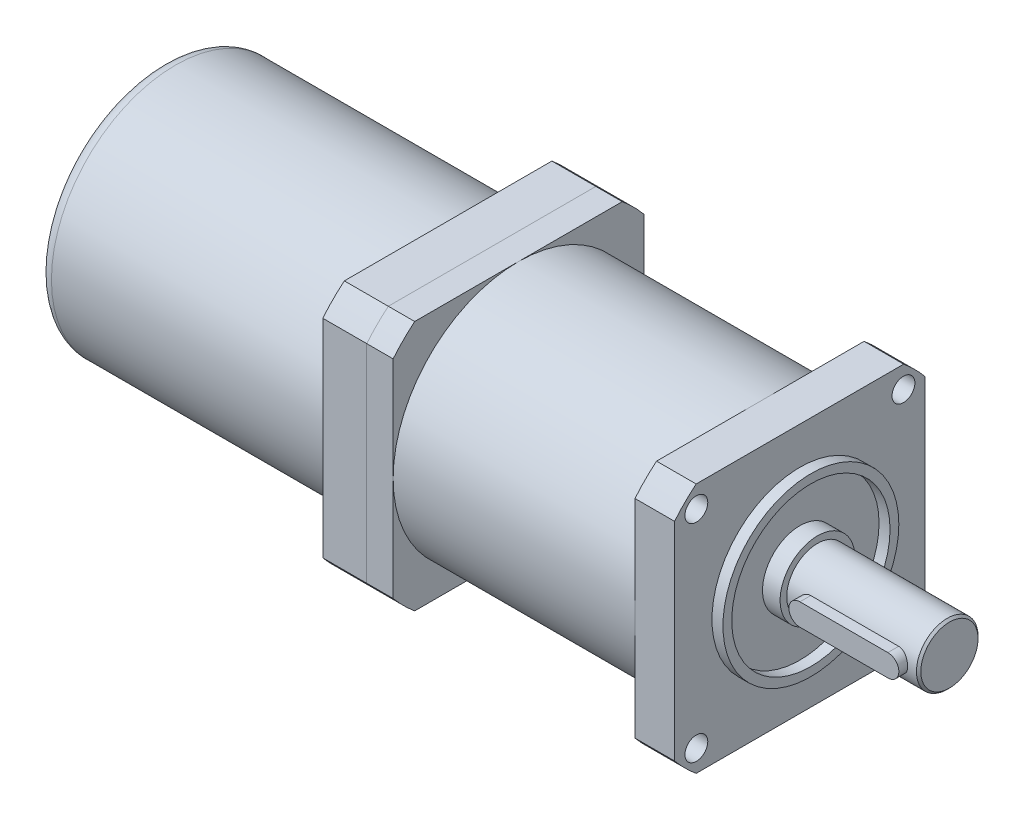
ISO-10303-21;
HEADER;
FILE_DESCRIPTION(('STEP AP214'),'2;1');
FILE_NAME('part.step','',(''),(''),'','','');
FILE_SCHEMA(('AUTOMOTIVE_DESIGN { 1 0 10303 214 1 1 1 1 }'));
ENDSEC;
DATA;
#1=APPLICATION_CONTEXT('core data for automotive mechanical design processes');
#2=APPLICATION_PROTOCOL_DEFINITION('international standard','automotive_design',2000,#1);
#3=PRODUCT_CONTEXT('',#1,'mechanical');
#4=PRODUCT('Part','Part','',(#3));
#5=PRODUCT_RELATED_PRODUCT_CATEGORY('part','',(#4));
#6=PRODUCT_DEFINITION_FORMATION('','',#4);
#7=PRODUCT_DEFINITION_CONTEXT('part definition',#1,'design');
#8=PRODUCT_DEFINITION('design','',#6,#7);
#9=PRODUCT_DEFINITION_SHAPE('','',#8);
#10=(LENGTH_UNIT() NAMED_UNIT(*) SI_UNIT(.MILLI.,.METRE.));
#11=(NAMED_UNIT(*) PLANE_ANGLE_UNIT() SI_UNIT($,.RADIAN.));
#12=(NAMED_UNIT(*) SI_UNIT($,.STERADIAN.) SOLID_ANGLE_UNIT());
#13=UNCERTAINTY_MEASURE_WITH_UNIT(LENGTH_MEASURE(1.E-05),#10,'distance_accuracy_value','');
#14=(GEOMETRIC_REPRESENTATION_CONTEXT(3) GLOBAL_UNCERTAINTY_ASSIGNED_CONTEXT((#13)) GLOBAL_UNIT_ASSIGNED_CONTEXT((#10,
#11,#12)) REPRESENTATION_CONTEXT('',''));
#15=CARTESIAN_POINT('',(0.,0.,0.));
#16=DIRECTION('',(0.,0.,1.));
#17=DIRECTION('',(1.,0.,0.));
#18=AXIS2_PLACEMENT_3D('',#15,#16,#17);
#19=CARTESIAN_POINT('',(-80.,0.,0.));
#20=DIRECTION('',(-1.,0.,0.));
#21=DIRECTION('',(0.,0.,1.));
#22=AXIS2_PLACEMENT_3D('',#19,#20,#21);
#23=PLANE('',#22);
#24=CARTESIAN_POINT('',(-80.,0.,0.));
#25=DIRECTION('',(-1.,0.,0.));
#26=DIRECTION('',(0.,0.,1.));
#27=AXIS2_PLACEMENT_3D('',#24,#25,#26);
#28=CIRCLE('',#27,37.);
#29=CARTESIAN_POINT('',(-80.,28.5,-23.5955504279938));
#30=VERTEX_POINT('',#29);
#31=CARTESIAN_POINT('',(-80.,23.5955504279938,-28.5));
#32=VERTEX_POINT('',#31);
#33=EDGE_CURVE('E158',#30,#32,#28,.T.);
#34=ORIENTED_EDGE('',*,*,#33,.T.);
#35=DIRECTION('',(0.,-1.,0.));
#36=VECTOR('',#35,1.);
#37=CARTESIAN_POINT('',(-80.,-23.5955504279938,-28.5));
#38=LINE('',#37,#36);
#39=CARTESIAN_POINT('',(-80.,-23.5955504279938,-28.5));
#40=VERTEX_POINT('',#39);
#41=EDGE_CURVE('E106',#32,#40,#38,.T.);
#42=ORIENTED_EDGE('',*,*,#41,.T.);
#43=CARTESIAN_POINT('',(-80.,0.,0.));
#44=DIRECTION('',(-1.,0.,0.));
#45=DIRECTION('',(0.,0.,1.));
#46=AXIS2_PLACEMENT_3D('',#43,#44,#45);
#47=CIRCLE('',#46,37.);
#48=CARTESIAN_POINT('',(-80.,-28.5,-23.5955504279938));
#49=VERTEX_POINT('',#48);
#50=EDGE_CURVE('E226',#40,#49,#47,.T.);
#51=ORIENTED_EDGE('',*,*,#50,.T.);
#52=DIRECTION('',(0.,0.,1.));
#53=VECTOR('',#52,1.);
#54=CARTESIAN_POINT('',(-80.,-28.5,-23.5955504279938));
#55=LINE('',#54,#53);
#56=CARTESIAN_POINT('',(-80.,-28.5,23.5955504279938));
#57=VERTEX_POINT('',#56);
#58=EDGE_CURVE('E231',#49,#57,#55,.T.);
#59=ORIENTED_EDGE('',*,*,#58,.T.);
#60=CARTESIAN_POINT('',(-80.,0.,0.));
#61=DIRECTION('',(-1.,0.,0.));
#62=DIRECTION('',(0.,0.,1.));
#63=AXIS2_PLACEMENT_3D('',#60,#61,#62);
#64=CIRCLE('',#63,37.);
#65=CARTESIAN_POINT('',(-80.,-23.5955504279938,28.5));
#66=VERTEX_POINT('',#65);
#67=EDGE_CURVE('E125',#57,#66,#64,.T.);
#68=ORIENTED_EDGE('',*,*,#67,.T.);
#69=DIRECTION('',(0.,1.,0.));
#70=VECTOR('',#69,1.);
#71=CARTESIAN_POINT('',(-80.,-23.5955504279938,28.5));
#72=LINE('',#71,#70);
#73=CARTESIAN_POINT('',(-80.,23.5955504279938,28.5));
#74=VERTEX_POINT('',#73);
#75=EDGE_CURVE('E119',#66,#74,#72,.T.);
#76=ORIENTED_EDGE('',*,*,#75,.T.);
#77=CARTESIAN_POINT('',(-80.,0.,0.));
#78=DIRECTION('',(-1.,0.,0.));
#79=DIRECTION('',(0.,0.,1.));
#80=AXIS2_PLACEMENT_3D('',#77,#78,#79);
#81=CIRCLE('',#80,37.);
#82=CARTESIAN_POINT('',(-80.,28.5,23.5955504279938));
#83=VERTEX_POINT('',#82);
#84=EDGE_CURVE('E123',#74,#83,#81,.T.);
#85=ORIENTED_EDGE('',*,*,#84,.T.);
#86=DIRECTION('',(0.,0.,-1.));
#87=VECTOR('',#86,1.);
#88=CARTESIAN_POINT('',(-80.,28.5,-23.5955504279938));
#89=LINE('',#88,#87);
#90=EDGE_CURVE('E62',#83,#30,#89,.T.);
#91=ORIENTED_EDGE('',*,*,#90,.T.);
#92=EDGE_LOOP('',(#34,#42,#51,#59,#68,#76,#85,#91));
#93=FACE_BOUND('',#92,.T.);
#94=CARTESIAN_POINT('',(-80.,0.,0.));
#95=DIRECTION('',(-1.,0.,0.));
#96=DIRECTION('',(0.,0.,1.));
#97=AXIS2_PLACEMENT_3D('',#94,#95,#96);
#98=CIRCLE('',#97,28.2);
#99=CARTESIAN_POINT('',(-80.,0.,28.2));
#100=VERTEX_POINT('',#99);
#101=EDGE_CURVE('E147',#100,#100,#98,.T.);
#102=ORIENTED_EDGE('',*,*,#101,.F.);
#103=EDGE_LOOP('',(#102));
#104=FACE_BOUND('',#103,.T.);
#105=ADVANCED_FACE('F45',(#93,#104),#23,.T.);
#106=CARTESIAN_POINT('',(-80.,0.,0.));
#107=DIRECTION('',(1.,0.,0.));
#108=DIRECTION('',(0.,0.,-1.));
#109=AXIS2_PLACEMENT_3D('',#106,#107,#108);
#110=CYLINDRICAL_SURFACE('',#109,37.);
#111=CARTESIAN_POINT('',(-70.,0.,0.));
#112=DIRECTION('',(-1.,0.,0.));
#113=DIRECTION('',(0.,0.,1.));
#114=AXIS2_PLACEMENT_3D('',#111,#112,#113);
#115=CIRCLE('',#114,37.);
#116=CARTESIAN_POINT('',(-70.,28.5,-23.5955504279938));
#117=VERTEX_POINT('',#116);
#118=CARTESIAN_POINT('',(-70.,23.5955504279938,-28.5));
#119=VERTEX_POINT('',#118);
#120=EDGE_CURVE('E143',#117,#119,#115,.T.);
#121=ORIENTED_EDGE('',*,*,#120,.T.);
#122=DIRECTION('',(1.,0.,0.));
#123=VECTOR('',#122,1.);
#124=CARTESIAN_POINT('',(-80.,23.5955504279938,-28.5));
#125=LINE('',#124,#123);
#126=EDGE_CURVE('E171',#32,#119,#125,.T.);
#127=ORIENTED_EDGE('',*,*,#126,.F.);
#128=ORIENTED_EDGE('',*,*,#33,.F.);
#129=DIRECTION('',(1.,0.,0.));
#130=VECTOR('',#129,1.);
#131=CARTESIAN_POINT('',(-80.,28.5,-23.5955504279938));
#132=LINE('',#131,#130);
#133=EDGE_CURVE('E139',#30,#117,#132,.T.);
#134=ORIENTED_EDGE('',*,*,#133,.T.);
#135=EDGE_LOOP('',(#121,#127,#128,#134));
#136=FACE_BOUND('',#135,.T.);
#137=ADVANCED_FACE('F186',(#136),#110,.T.);
#138=CARTESIAN_POINT('',(-80.,-23.5955504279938,-28.5));
#139=DIRECTION('',(0.,0.,1.));
#140=DIRECTION('',(1.,0.,0.));
#141=AXIS2_PLACEMENT_3D('',#138,#139,#140);
#142=PLANE('',#141);
#143=DIRECTION('',(0.,-1.,0.));
#144=VECTOR('',#143,1.);
#145=CARTESIAN_POINT('',(-70.,-23.5955504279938,-28.5));
#146=LINE('',#145,#144);
#147=CARTESIAN_POINT('',(-70.,-23.5955504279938,-28.5));
#148=VERTEX_POINT('',#147);
#149=EDGE_CURVE('E146',#119,#148,#146,.T.);
#150=ORIENTED_EDGE('',*,*,#149,.T.);
#151=DIRECTION('',(1.,0.,0.));
#152=VECTOR('',#151,1.);
#153=CARTESIAN_POINT('',(-80.,-23.5955504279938,-28.5));
#154=LINE('',#153,#152);
#155=EDGE_CURVE('E168',#40,#148,#154,.T.);
#156=ORIENTED_EDGE('',*,*,#155,.F.);
#157=ORIENTED_EDGE('',*,*,#41,.F.);
#158=ORIENTED_EDGE('',*,*,#126,.T.);
#159=EDGE_LOOP('',(#150,#156,#157,#158));
#160=FACE_BOUND('',#159,.T.);
#161=ADVANCED_FACE('F191',(#160),#142,.F.);
#162=CARTESIAN_POINT('',(-80.,0.,0.));
#163=DIRECTION('',(1.,0.,0.));
#164=DIRECTION('',(0.,0.,-1.));
#165=AXIS2_PLACEMENT_3D('',#162,#163,#164);
#166=CYLINDRICAL_SURFACE('',#165,37.);
#167=CARTESIAN_POINT('',(-70.,0.,0.));
#168=DIRECTION('',(-1.,0.,0.));
#169=DIRECTION('',(0.,0.,1.));
#170=AXIS2_PLACEMENT_3D('',#167,#168,#169);
#171=CIRCLE('',#170,37.);
#172=CARTESIAN_POINT('',(-70.,-28.5,-23.5955504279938));
#173=VERTEX_POINT('',#172);
#174=EDGE_CURVE('E149',#148,#173,#171,.T.);
#175=ORIENTED_EDGE('',*,*,#174,.T.);
#176=DIRECTION('',(1.,0.,0.));
#177=VECTOR('',#176,1.);
#178=CARTESIAN_POINT('',(-80.,-28.5,-23.5955504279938));
#179=LINE('',#178,#177);
#180=EDGE_CURVE('E165',#49,#173,#179,.T.);
#181=ORIENTED_EDGE('',*,*,#180,.F.);
#182=ORIENTED_EDGE('',*,*,#50,.F.);
#183=ORIENTED_EDGE('',*,*,#155,.T.);
#184=EDGE_LOOP('',(#175,#181,#182,#183));
#185=FACE_BOUND('',#184,.T.);
#186=ADVANCED_FACE('F213',(#185),#166,.T.);
#187=CARTESIAN_POINT('',(-80.,-28.5,-23.5955504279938));
#188=DIRECTION('',(0.,1.,0.));
#189=DIRECTION('',(0.,0.,1.));
#190=AXIS2_PLACEMENT_3D('',#187,#188,#189);
#191=PLANE('',#190);
#192=DIRECTION('',(0.,0.,1.));
#193=VECTOR('',#192,1.);
#194=CARTESIAN_POINT('',(-70.,-28.5,-23.5955504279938));
#195=LINE('',#194,#193);
#196=CARTESIAN_POINT('',(-70.,-28.5,23.5955504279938));
#197=VERTEX_POINT('',#196);
#198=EDGE_CURVE('E151',#173,#197,#195,.T.);
#199=ORIENTED_EDGE('',*,*,#198,.T.);
#200=DIRECTION('',(1.,0.,0.));
#201=VECTOR('',#200,1.);
#202=CARTESIAN_POINT('',(-80.,-28.5,23.5955504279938));
#203=LINE('',#202,#201);
#204=EDGE_CURVE('E162',#57,#197,#203,.T.);
#205=ORIENTED_EDGE('',*,*,#204,.F.);
#206=ORIENTED_EDGE('',*,*,#58,.F.);
#207=ORIENTED_EDGE('',*,*,#180,.T.);
#208=EDGE_LOOP('',(#199,#205,#206,#207));
#209=FACE_BOUND('',#208,.T.);
#210=ADVANCED_FACE('F209',(#209),#191,.F.);
#211=CARTESIAN_POINT('',(-80.,0.,0.));
#212=DIRECTION('',(1.,0.,0.));
#213=DIRECTION('',(0.,0.,-1.));
#214=AXIS2_PLACEMENT_3D('',#211,#212,#213);
#215=CYLINDRICAL_SURFACE('',#214,37.);
#216=CARTESIAN_POINT('',(-70.,0.,0.));
#217=DIRECTION('',(-1.,0.,0.));
#218=DIRECTION('',(0.,0.,1.));
#219=AXIS2_PLACEMENT_3D('',#216,#217,#218);
#220=CIRCLE('',#219,37.);
#221=CARTESIAN_POINT('',(-70.,-23.5955504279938,28.5));
#222=VERTEX_POINT('',#221);
#223=EDGE_CURVE('E153',#197,#222,#220,.T.);
#224=ORIENTED_EDGE('',*,*,#223,.T.);
#225=DIRECTION('',(1.,0.,0.));
#226=VECTOR('',#225,1.);
#227=CARTESIAN_POINT('',(-80.,-23.5955504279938,28.5));
#228=LINE('',#227,#226);
#229=EDGE_CURVE('E134',#66,#222,#228,.T.);
#230=ORIENTED_EDGE('',*,*,#229,.F.);
#231=ORIENTED_EDGE('',*,*,#67,.F.);
#232=ORIENTED_EDGE('',*,*,#204,.T.);
#233=EDGE_LOOP('',(#224,#230,#231,#232));
#234=FACE_BOUND('',#233,.T.);
#235=ADVANCED_FACE('F206',(#234),#215,.T.);
#236=CARTESIAN_POINT('',(-80.,-23.5955504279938,28.5));
#237=DIRECTION('',(0.,0.,-1.));
#238=DIRECTION('',(-1.,0.,0.));
#239=AXIS2_PLACEMENT_3D('',#236,#237,#238);
#240=PLANE('',#239);
#241=DIRECTION('',(0.,1.,0.));
#242=VECTOR('',#241,1.);
#243=CARTESIAN_POINT('',(-70.,-23.5955504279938,28.5));
#244=LINE('',#243,#242);
#245=CARTESIAN_POINT('',(-70.,23.5955504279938,28.5));
#246=VERTEX_POINT('',#245);
#247=EDGE_CURVE('E133',#222,#246,#244,.T.);
#248=ORIENTED_EDGE('',*,*,#247,.T.);
#249=DIRECTION('',(1.,0.,0.));
#250=VECTOR('',#249,1.);
#251=CARTESIAN_POINT('',(-80.,23.5955504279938,28.5));
#252=LINE('',#251,#250);
#253=EDGE_CURVE('E130',#74,#246,#252,.T.);
#254=ORIENTED_EDGE('',*,*,#253,.F.);
#255=ORIENTED_EDGE('',*,*,#75,.F.);
#256=ORIENTED_EDGE('',*,*,#229,.T.);
#257=EDGE_LOOP('',(#248,#254,#255,#256));
#258=FACE_BOUND('',#257,.T.);
#259=ADVANCED_FACE('F131',(#258),#240,.F.);
#260=CARTESIAN_POINT('',(-80.,0.,0.));
#261=DIRECTION('',(1.,0.,0.));
#262=DIRECTION('',(0.,0.,-1.));
#263=AXIS2_PLACEMENT_3D('',#260,#261,#262);
#264=CYLINDRICAL_SURFACE('',#263,37.);
#265=CARTESIAN_POINT('',(-70.,0.,0.));
#266=DIRECTION('',(-1.,0.,0.));
#267=DIRECTION('',(0.,0.,1.));
#268=AXIS2_PLACEMENT_3D('',#265,#266,#267);
#269=CIRCLE('',#268,37.);
#270=CARTESIAN_POINT('',(-70.,28.5,23.5955504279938));
#271=VERTEX_POINT('',#270);
#272=EDGE_CURVE('E91',#246,#271,#269,.T.);
#273=ORIENTED_EDGE('',*,*,#272,.T.);
#274=DIRECTION('',(1.,0.,0.));
#275=VECTOR('',#274,1.);
#276=CARTESIAN_POINT('',(-80.,28.5,23.5955504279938));
#277=LINE('',#276,#275);
#278=EDGE_CURVE('E135',#83,#271,#277,.T.);
#279=ORIENTED_EDGE('',*,*,#278,.F.);
#280=ORIENTED_EDGE('',*,*,#84,.F.);
#281=ORIENTED_EDGE('',*,*,#253,.T.);
#282=EDGE_LOOP('',(#273,#279,#280,#281));
#283=FACE_BOUND('',#282,.T.);
#284=ADVANCED_FACE('F137',(#283),#264,.T.);
#285=CARTESIAN_POINT('',(-80.,28.5,-23.5955504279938));
#286=DIRECTION('',(0.,-1.,0.));
#287=DIRECTION('',(0.,0.,-1.));
#288=AXIS2_PLACEMENT_3D('',#285,#286,#287);
#289=PLANE('',#288);
#290=DIRECTION('',(0.,0.,-1.));
#291=VECTOR('',#290,1.);
#292=CARTESIAN_POINT('',(-70.,28.5,-23.5955504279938));
#293=LINE('',#292,#291);
#294=EDGE_CURVE('E97',#271,#117,#293,.T.);
#295=ORIENTED_EDGE('',*,*,#294,.T.);
#296=ORIENTED_EDGE('',*,*,#133,.F.);
#297=ORIENTED_EDGE('',*,*,#90,.F.);
#298=ORIENTED_EDGE('',*,*,#278,.T.);
#299=EDGE_LOOP('',(#295,#296,#297,#298));
#300=FACE_BOUND('',#299,.T.);
#301=ADVANCED_FACE('F198',(#300),#289,.F.);
#302=CARTESIAN_POINT('',(-70.,0.,0.));
#303=DIRECTION('',(-1.,0.,0.));
#304=DIRECTION('',(0.,0.,1.));
#305=AXIS2_PLACEMENT_3D('',#302,#303,#304);
#306=PLANE('',#305);
#307=ORIENTED_EDGE('',*,*,#120,.F.);
#308=ORIENTED_EDGE('',*,*,#294,.F.);
#309=ORIENTED_EDGE('',*,*,#272,.F.);
#310=ORIENTED_EDGE('',*,*,#247,.F.);
#311=ORIENTED_EDGE('',*,*,#223,.F.);
#312=ORIENTED_EDGE('',*,*,#198,.F.);
#313=ORIENTED_EDGE('',*,*,#174,.F.);
#314=ORIENTED_EDGE('',*,*,#149,.F.);
#315=EDGE_LOOP('',(#307,#308,#309,#310,#311,#312,#313,#314));
#316=FACE_BOUND('',#315,.T.);
#317=ADVANCED_FACE('F195',(#316),#306,.F.);
#318=CARTESIAN_POINT('',(-145.,0.,0.));
#319=DIRECTION('',(1.,0.,0.));
#320=DIRECTION('',(0.,0.,-1.));
#321=AXIS2_PLACEMENT_3D('',#318,#319,#320);
#322=CYLINDRICAL_SURFACE('',#321,28.2);
#323=CARTESIAN_POINT('',(-142.,0.,0.));
#324=DIRECTION('',(-1.,0.,0.));
#325=DIRECTION('',(0.,0.,1.));
#326=AXIS2_PLACEMENT_3D('',#323,#324,#325);
#327=CIRCLE('',#326,28.2);
#328=CARTESIAN_POINT('',(-142.,0.,28.2));
#329=VERTEX_POINT('',#328);
#330=EDGE_CURVE('E12',#329,#329,#327,.F.);
#331=ORIENTED_EDGE('',*,*,#330,.T.);
#332=EDGE_LOOP('',(#331));
#333=FACE_BOUND('',#332,.T.);
#334=ORIENTED_EDGE('',*,*,#101,.T.);
#335=EDGE_LOOP('',(#334));
#336=FACE_BOUND('',#335,.T.);
#337=ADVANCED_FACE('F182',(#333,#336),#322,.T.);
#338=CARTESIAN_POINT('',(-145.,0.,0.));
#339=DIRECTION('',(-1.,0.,0.));
#340=DIRECTION('',(0.,0.,1.));
#341=AXIS2_PLACEMENT_3D('',#338,#339,#340);
#342=PLANE('',#341);
#343=CARTESIAN_POINT('',(-145.,0.,0.));
#344=DIRECTION('',(-1.,0.,0.));
#345=DIRECTION('',(0.,0.,1.));
#346=AXIS2_PLACEMENT_3D('',#343,#344,#345);
#347=CIRCLE('',#346,25.2);
#348=CARTESIAN_POINT('',(-145.,0.,25.2));
#349=VERTEX_POINT('',#348);
#350=EDGE_CURVE('E54',#349,#349,#347,.T.);
#351=ORIENTED_EDGE('',*,*,#350,.T.);
#352=EDGE_LOOP('',(#351));
#353=FACE_BOUND('',#352,.T.);
#354=ADVANCED_FACE('F175',(#353),#342,.T.);
#355=CARTESIAN_POINT('',(-142.,0.,0.));
#356=DIRECTION('',(-1.,0.,0.));
#357=DIRECTION('',(0.,0.,1.));
#358=AXIS2_PLACEMENT_3D('',#355,#356,#357);
#359=TOROIDAL_SURFACE('',#358,25.2,3.);
#360=ORIENTED_EDGE('',*,*,#330,.F.);
#361=EDGE_LOOP('',(#360));
#362=FACE_BOUND('',#361,.T.);
#363=ORIENTED_EDGE('',*,*,#350,.F.);
#364=EDGE_LOOP('',(#363));
#365=FACE_BOUND('',#364,.T.);
#366=ADVANCED_FACE('F47',(#362,#365),#359,.T.);
#367=CLOSED_SHELL('',(#105,#137,#161,#186,#210,#235,#259,#284,#301,#317,#337,#354,#366));
#368=MANIFOLD_SOLID_BREP('B2',#367);
#369=CARTESIAN_POINT('',(4.,0.,0.));
#370=DIRECTION('',(1.,0.,0.));
#371=DIRECTION('',(0.,0.,-1.));
#372=AXIS2_PLACEMENT_3D('',#369,#370,#371);
#373=PLANE('',#372);
#374=CARTESIAN_POINT('',(4.,0.,0.));
#375=DIRECTION('',(1.,0.,0.));
#376=DIRECTION('',(0.,0.,-1.));
#377=AXIS2_PLACEMENT_3D('',#374,#375,#376);
#378=CIRCLE('',#377,8.5);
#379=CARTESIAN_POINT('',(4.,0.,-8.5));
#380=VERTEX_POINT('',#379);
#381=EDGE_CURVE('E510',#380,#380,#378,.T.);
#382=ORIENTED_EDGE('',*,*,#381,.T.);
#383=EDGE_LOOP('',(#382));
#384=FACE_BOUND('',#383,.T.);
#385=CARTESIAN_POINT('',(4.,0.,0.));
#386=DIRECTION('',(1.,0.,0.));
#387=DIRECTION('',(0.,0.,-1.));
#388=AXIS2_PLACEMENT_3D('',#385,#386,#387);
#389=CIRCLE('',#388,7.);
#390=CARTESIAN_POINT('',(4.,0.,-7.));
#391=VERTEX_POINT('',#390);
#392=EDGE_CURVE('E501',#391,#391,#389,.T.);
#393=ORIENTED_EDGE('',*,*,#392,.F.);
#394=EDGE_LOOP('',(#393));
#395=FACE_BOUND('',#394,.T.);
#396=ADVANCED_FACE('F318',(#384,#395),#373,.T.);
#397=CARTESIAN_POINT('',(0.,0.,0.));
#398=DIRECTION('',(1.,0.,0.));
#399=DIRECTION('',(0.,0.,-1.));
#400=AXIS2_PLACEMENT_3D('',#397,#398,#399);
#401=PLANE('',#400);
#402=CARTESIAN_POINT('',(0.,0.,0.));
#403=DIRECTION('',(1.,0.,0.));
#404=DIRECTION('',(0.,0.,-1.));
#405=AXIS2_PLACEMENT_3D('',#402,#403,#404);
#406=CIRCLE('',#405,18.);
#407=CARTESIAN_POINT('',(0.,0.,-18.));
#408=VERTEX_POINT('',#407);
#409=EDGE_CURVE('E690',#408,#408,#406,.F.);
#410=ORIENTED_EDGE('',*,*,#409,.F.);
#411=EDGE_LOOP('',(#410));
#412=FACE_BOUND('',#411,.T.);
#413=CARTESIAN_POINT('',(0.,0.,0.));
#414=DIRECTION('',(1.,0.,0.));
#415=DIRECTION('',(0.,0.,-1.));
#416=AXIS2_PLACEMENT_3D('',#413,#414,#415);
#417=CIRCLE('',#416,8.5);
#418=CARTESIAN_POINT('',(0.,0.,-8.5));
#419=VERTEX_POINT('',#418);
#420=EDGE_CURVE('E504',#419,#419,#417,.T.);
#421=ORIENTED_EDGE('',*,*,#420,.F.);
#422=EDGE_LOOP('',(#421));
#423=FACE_BOUND('',#422,.T.);
#424=ADVANCED_FACE('F725',(#412,#423),#401,.T.);
#425=CARTESIAN_POINT('',(0.,-23.55,23.55));
#426=DIRECTION('',(1.,0.,0.));
#427=DIRECTION('',(0.,0.,-1.));
#428=AXIS2_PLACEMENT_3D('',#425,#426,#427);
#429=CIRCLE('',#428,2.6);
#430=CARTESIAN_POINT('',(0.,-23.55,20.95));
#431=VERTEX_POINT('',#430);
#432=EDGE_CURVE('E522',#431,#431,#429,.T.);
#433=ORIENTED_EDGE('',*,*,#432,.F.);
#434=EDGE_LOOP('',(#433));
#435=FACE_BOUND('',#434,.T.);
#436=CARTESIAN_POINT('',(0.,-23.55,-23.55));
#437=DIRECTION('',(1.,0.,0.));
#438=DIRECTION('',(0.,0.,-1.));
#439=AXIS2_PLACEMENT_3D('',#436,#437,#438);
#440=CIRCLE('',#439,2.6);
#441=CARTESIAN_POINT('',(0.,-23.55,-26.15));
#442=VERTEX_POINT('',#441);
#443=EDGE_CURVE('E528',#442,#442,#440,.T.);
#444=ORIENTED_EDGE('',*,*,#443,.F.);
#445=EDGE_LOOP('',(#444));
#446=FACE_BOUND('',#445,.T.);
#447=CARTESIAN_POINT('',(0.,23.55,-23.55));
#448=DIRECTION('',(1.,0.,0.));
#449=DIRECTION('',(0.,0.,-1.));
#450=AXIS2_PLACEMENT_3D('',#447,#448,#449);
#451=CIRCLE('',#450,2.6);
#452=CARTESIAN_POINT('',(0.,23.55,-26.15));
#453=VERTEX_POINT('',#452);
#454=EDGE_CURVE('E534',#453,#453,#451,.T.);
#455=ORIENTED_EDGE('',*,*,#454,.F.);
#456=EDGE_LOOP('',(#455));
#457=FACE_BOUND('',#456,.T.);
#458=CARTESIAN_POINT('',(0.,23.55,23.55));
#459=DIRECTION('',(1.,0.,0.));
#460=DIRECTION('',(0.,0.,-1.));
#461=AXIS2_PLACEMENT_3D('',#458,#459,#460);
#462=CIRCLE('',#461,2.6);
#463=CARTESIAN_POINT('',(0.,23.55,20.95));
#464=VERTEX_POINT('',#463);
#465=EDGE_CURVE('E540',#464,#464,#462,.T.);
#466=ORIENTED_EDGE('',*,*,#465,.F.);
#467=EDGE_LOOP('',(#466));
#468=FACE_BOUND('',#467,.T.);
#469=CARTESIAN_POINT('',(0.,0.,0.));
#470=DIRECTION('',(1.,0.,0.));
#471=DIRECTION('',(0.,0.,-1.));
#472=AXIS2_PLACEMENT_3D('',#469,#470,#471);
#473=CIRCLE('',#472,37.);
#474=CARTESIAN_POINT('',(0.,23.5955504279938,-28.5));
#475=VERTEX_POINT('',#474);
#476=CARTESIAN_POINT('',(0.,28.5,-23.5955504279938));
#477=VERTEX_POINT('',#476);
#478=EDGE_CURVE('E618',#475,#477,#473,.T.);
#479=ORIENTED_EDGE('',*,*,#478,.T.);
#480=DIRECTION('',(0.,0.,1.));
#481=VECTOR('',#480,1.);
#482=CARTESIAN_POINT('',(0.,28.5,23.5955504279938));
#483=LINE('',#482,#481);
#484=CARTESIAN_POINT('',(0.,28.5,23.5955504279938));
#485=VERTEX_POINT('',#484);
#486=EDGE_CURVE('E655',#477,#485,#483,.T.);
#487=ORIENTED_EDGE('',*,*,#486,.T.);
#488=CARTESIAN_POINT('',(0.,0.,0.));
#489=DIRECTION('',(1.,0.,0.));
#490=DIRECTION('',(0.,0.,-1.));
#491=AXIS2_PLACEMENT_3D('',#488,#489,#490);
#492=CIRCLE('',#491,37.);
#493=CARTESIAN_POINT('',(0.,23.5955504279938,28.5));
#494=VERTEX_POINT('',#493);
#495=EDGE_CURVE('E658',#485,#494,#492,.T.);
#496=ORIENTED_EDGE('',*,*,#495,.T.);
#497=DIRECTION('',(0.,-1.,0.));
#498=VECTOR('',#497,1.);
#499=CARTESIAN_POINT('',(0.,-23.5955504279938,28.5));
#500=LINE('',#499,#498);
#501=CARTESIAN_POINT('',(0.,-23.5955504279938,28.5));
#502=VERTEX_POINT('',#501);
#503=EDGE_CURVE('E661',#494,#502,#500,.T.);
#504=ORIENTED_EDGE('',*,*,#503,.T.);
#505=CARTESIAN_POINT('',(0.,0.,0.));
#506=DIRECTION('',(1.,0.,0.));
#507=DIRECTION('',(0.,0.,-1.));
#508=AXIS2_PLACEMENT_3D('',#505,#506,#507);
#509=CIRCLE('',#508,37.);
#510=CARTESIAN_POINT('',(0.,-28.5,23.5955504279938));
#511=VERTEX_POINT('',#510);
#512=EDGE_CURVE('E664',#502,#511,#509,.T.);
#513=ORIENTED_EDGE('',*,*,#512,.T.);
#514=DIRECTION('',(0.,0.,-1.));
#515=VECTOR('',#514,1.);
#516=CARTESIAN_POINT('',(0.,-28.5,23.5955504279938));
#517=LINE('',#516,#515);
#518=CARTESIAN_POINT('',(0.,-28.5,-23.5955504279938));
#519=VERTEX_POINT('',#518);
#520=EDGE_CURVE('E667',#511,#519,#517,.T.);
#521=ORIENTED_EDGE('',*,*,#520,.T.);
#522=CARTESIAN_POINT('',(0.,0.,0.));
#523=DIRECTION('',(1.,0.,0.));
#524=DIRECTION('',(0.,0.,-1.));
#525=AXIS2_PLACEMENT_3D('',#522,#523,#524);
#526=CIRCLE('',#525,37.);
#527=CARTESIAN_POINT('',(0.,-23.5955504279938,-28.5));
#528=VERTEX_POINT('',#527);
#529=EDGE_CURVE('E670',#519,#528,#526,.T.);
#530=ORIENTED_EDGE('',*,*,#529,.T.);
#531=DIRECTION('',(0.,1.,0.));
#532=VECTOR('',#531,1.);
#533=CARTESIAN_POINT('',(0.,-23.5955504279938,-28.5));
#534=LINE('',#533,#532);
#535=EDGE_CURVE('E628',#528,#475,#534,.T.);
#536=ORIENTED_EDGE('',*,*,#535,.T.);
#537=EDGE_LOOP('',(#479,#487,#496,#504,#513,#521,#530,#536));
#538=FACE_BOUND('',#537,.T.);
#539=CARTESIAN_POINT('',(0.,0.,0.));
#540=DIRECTION('',(1.,0.,0.));
#541=DIRECTION('',(0.,0.,-1.));
#542=AXIS2_PLACEMENT_3D('',#539,#540,#541);
#543=CIRCLE('',#542,20.);
#544=CARTESIAN_POINT('',(0.,0.,-20.));
#545=VERTEX_POINT('',#544);
#546=EDGE_CURVE('E518',#545,#545,#543,.T.);
#547=ORIENTED_EDGE('',*,*,#546,.F.);
#548=EDGE_LOOP('',(#547));
#549=FACE_BOUND('',#548,.T.);
#550=ADVANCED_FACE('F730',(#435,#446,#457,#468,#538,#549),#401,.T.);
#551=CARTESIAN_POINT('',(-9.,0.,0.));
#552=DIRECTION('',(1.,0.,0.));
#553=DIRECTION('',(0.,0.,-1.));
#554=AXIS2_PLACEMENT_3D('',#551,#552,#553);
#555=PLANE('',#554);
#556=CARTESIAN_POINT('',(-9.,23.55,23.55));
#557=DIRECTION('',(1.,0.,0.));
#558=DIRECTION('',(0.,0.,-1.));
#559=AXIS2_PLACEMENT_3D('',#556,#557,#558);
#560=CIRCLE('',#559,2.6);
#561=CARTESIAN_POINT('',(-9.,23.55,20.95));
#562=VERTEX_POINT('',#561);
#563=EDGE_CURVE('E543',#562,#562,#560,.T.);
#564=ORIENTED_EDGE('',*,*,#563,.T.);
#565=EDGE_LOOP('',(#564));
#566=FACE_BOUND('',#565,.T.);
#567=CARTESIAN_POINT('',(-9.,0.,0.));
#568=DIRECTION('',(-1.,0.,0.));
#569=DIRECTION('',(0.,0.,1.));
#570=AXIS2_PLACEMENT_3D('',#567,#568,#569);
#571=CIRCLE('',#570,28.5);
#572=CARTESIAN_POINT('',(-9.,0.,28.5));
#573=VERTEX_POINT('',#572);
#574=CARTESIAN_POINT('',(-9.,28.5,0.));
#575=VERTEX_POINT('',#574);
#576=EDGE_CURVE('E614',#573,#575,#571,.T.);
#577=ORIENTED_EDGE('',*,*,#576,.F.);
#578=DIRECTION('',(0.,-1.,0.));
#579=VECTOR('',#578,1.);
#580=CARTESIAN_POINT('',(-9.,-23.5955504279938,28.5));
#581=LINE('',#580,#579);
#582=CARTESIAN_POINT('',(-9.,23.5955504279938,28.5));
#583=VERTEX_POINT('',#582);
#584=EDGE_CURVE('E636',#583,#573,#581,.T.);
#585=ORIENTED_EDGE('',*,*,#584,.F.);
#586=CARTESIAN_POINT('',(-9.,0.,0.));
#587=DIRECTION('',(1.,0.,0.));
#588=DIRECTION('',(0.,0.,-1.));
#589=AXIS2_PLACEMENT_3D('',#586,#587,#588);
#590=CIRCLE('',#589,37.);
#591=CARTESIAN_POINT('',(-9.,28.5,23.5955504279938));
#592=VERTEX_POINT('',#591);
#593=EDGE_CURVE('E632',#592,#583,#590,.T.);
#594=ORIENTED_EDGE('',*,*,#593,.F.);
#595=DIRECTION('',(0.,0.,1.));
#596=VECTOR('',#595,1.);
#597=CARTESIAN_POINT('',(-9.,28.5,23.5955504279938));
#598=LINE('',#597,#596);
#599=EDGE_CURVE('E627',#575,#592,#598,.T.);
#600=ORIENTED_EDGE('',*,*,#599,.F.);
#601=EDGE_LOOP('',(#577,#585,#594,#600));
#602=FACE_BOUND('',#601,.T.);
#603=ADVANCED_FACE('F812',(#566,#602),#555,.F.);
#604=CARTESIAN_POINT('',(-9.,23.55,-23.55));
#605=DIRECTION('',(1.,0.,0.));
#606=DIRECTION('',(0.,0.,-1.));
#607=AXIS2_PLACEMENT_3D('',#604,#605,#606);
#608=CIRCLE('',#607,2.6);
#609=CARTESIAN_POINT('',(-9.,23.55,-26.15));
#610=VERTEX_POINT('',#609);
#611=EDGE_CURVE('E537',#610,#610,#608,.T.);
#612=ORIENTED_EDGE('',*,*,#611,.T.);
#613=EDGE_LOOP('',(#612));
#614=FACE_BOUND('',#613,.T.);
#615=CARTESIAN_POINT('',(-9.,0.,-28.5));
#616=VERTEX_POINT('',#615);
#617=EDGE_CURVE('E622',#575,#616,#571,.T.);
#618=ORIENTED_EDGE('',*,*,#617,.F.);
#619=CARTESIAN_POINT('',(-9.,28.5,-23.5955504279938));
#620=VERTEX_POINT('',#619);
#621=EDGE_CURVE('E629',#620,#575,#598,.T.);
#622=ORIENTED_EDGE('',*,*,#621,.F.);
#623=CARTESIAN_POINT('',(-9.,0.,0.));
#624=DIRECTION('',(1.,0.,0.));
#625=DIRECTION('',(0.,0.,-1.));
#626=AXIS2_PLACEMENT_3D('',#623,#624,#625);
#627=CIRCLE('',#626,37.);
#628=CARTESIAN_POINT('',(-9.,23.5955504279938,-28.5));
#629=VERTEX_POINT('',#628);
#630=EDGE_CURVE('E624',#629,#620,#627,.T.);
#631=ORIENTED_EDGE('',*,*,#630,.F.);
#632=DIRECTION('',(0.,1.,0.));
#633=VECTOR('',#632,1.);
#634=CARTESIAN_POINT('',(-9.,-23.5955504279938,-28.5));
#635=LINE('',#634,#633);
#636=EDGE_CURVE('E648',#616,#629,#635,.T.);
#637=ORIENTED_EDGE('',*,*,#636,.F.);
#638=EDGE_LOOP('',(#618,#622,#631,#637));
#639=FACE_BOUND('',#638,.T.);
#640=ADVANCED_FACE('F814',(#614,#639),#555,.F.);
#641=CARTESIAN_POINT('',(-9.,-23.55,-23.55));
#642=DIRECTION('',(1.,0.,0.));
#643=DIRECTION('',(0.,0.,-1.));
#644=AXIS2_PLACEMENT_3D('',#641,#642,#643);
#645=CIRCLE('',#644,2.6);
#646=CARTESIAN_POINT('',(-9.,-23.55,-26.15));
#647=VERTEX_POINT('',#646);
#648=EDGE_CURVE('E531',#647,#647,#645,.T.);
#649=ORIENTED_EDGE('',*,*,#648,.T.);
#650=EDGE_LOOP('',(#649));
#651=FACE_BOUND('',#650,.T.);
#652=CARTESIAN_POINT('',(-9.,-28.5,0.));
#653=VERTEX_POINT('',#652);
#654=EDGE_CURVE('E886',#616,#653,#571,.T.);
#655=ORIENTED_EDGE('',*,*,#654,.F.);
#656=CARTESIAN_POINT('',(-9.,-23.5955504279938,-28.5));
#657=VERTEX_POINT('',#656);
#658=EDGE_CURVE('E649',#657,#616,#635,.T.);
#659=ORIENTED_EDGE('',*,*,#658,.F.);
#660=CARTESIAN_POINT('',(-9.,0.,0.));
#661=DIRECTION('',(1.,0.,0.));
#662=DIRECTION('',(0.,0.,-1.));
#663=AXIS2_PLACEMENT_3D('',#660,#661,#662);
#664=CIRCLE('',#663,37.);
#665=CARTESIAN_POINT('',(-9.,-28.5,-23.5955504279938));
#666=VERTEX_POINT('',#665);
#667=EDGE_CURVE('E645',#666,#657,#664,.T.);
#668=ORIENTED_EDGE('',*,*,#667,.F.);
#669=DIRECTION('',(0.,0.,-1.));
#670=VECTOR('',#669,1.);
#671=CARTESIAN_POINT('',(-9.,-28.5,23.5955504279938));
#672=LINE('',#671,#670);
#673=EDGE_CURVE('E641',#653,#666,#672,.T.);
#674=ORIENTED_EDGE('',*,*,#673,.F.);
#675=EDGE_LOOP('',(#655,#659,#668,#674));
#676=FACE_BOUND('',#675,.T.);
#677=ADVANCED_FACE('F850',(#651,#676),#555,.F.);
#678=CARTESIAN_POINT('',(-9.,-23.55,23.55));
#679=DIRECTION('',(1.,0.,0.));
#680=DIRECTION('',(0.,0.,-1.));
#681=AXIS2_PLACEMENT_3D('',#678,#679,#680);
#682=CIRCLE('',#681,2.6);
#683=CARTESIAN_POINT('',(-9.,-23.55,20.95));
#684=VERTEX_POINT('',#683);
#685=EDGE_CURVE('E525',#684,#684,#682,.T.);
#686=ORIENTED_EDGE('',*,*,#685,.T.);
#687=EDGE_LOOP('',(#686));
#688=FACE_BOUND('',#687,.T.);
#689=EDGE_CURVE('E623',#653,#573,#571,.T.);
#690=ORIENTED_EDGE('',*,*,#689,.F.);
#691=CARTESIAN_POINT('',(-9.,-28.5,23.5955504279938));
#692=VERTEX_POINT('',#691);
#693=EDGE_CURVE('E642',#692,#653,#672,.T.);
#694=ORIENTED_EDGE('',*,*,#693,.F.);
#695=CARTESIAN_POINT('',(-9.,0.,0.));
#696=DIRECTION('',(1.,0.,0.));
#697=DIRECTION('',(0.,0.,-1.));
#698=AXIS2_PLACEMENT_3D('',#695,#696,#697);
#699=CIRCLE('',#698,37.);
#700=CARTESIAN_POINT('',(-9.,-23.5955504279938,28.5));
#701=VERTEX_POINT('',#700);
#702=EDGE_CURVE('E638',#701,#692,#699,.T.);
#703=ORIENTED_EDGE('',*,*,#702,.F.);
#704=EDGE_CURVE('E635',#573,#701,#581,.T.);
#705=ORIENTED_EDGE('',*,*,#704,.F.);
#706=EDGE_LOOP('',(#690,#694,#703,#705));
#707=FACE_BOUND('',#706,.T.);
#708=ADVANCED_FACE('F816',(#688,#707),#555,.F.);
#709=CARTESIAN_POINT('',(-9.,0.,0.));
#710=DIRECTION('',(1.,0.,0.));
#711=DIRECTION('',(0.,0.,-1.));
#712=AXIS2_PLACEMENT_3D('',#709,#710,#711);
#713=CYLINDRICAL_SURFACE('',#712,37.);
#714=ORIENTED_EDGE('',*,*,#478,.F.);
#715=DIRECTION('',(1.,0.,0.));
#716=VECTOR('',#715,1.);
#717=CARTESIAN_POINT('',(-9.,23.5955504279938,-28.5));
#718=LINE('',#717,#716);
#719=EDGE_CURVE('E675',#629,#475,#718,.T.);
#720=ORIENTED_EDGE('',*,*,#719,.F.);
#721=ORIENTED_EDGE('',*,*,#630,.T.);
#722=DIRECTION('',(1.,0.,0.));
#723=VECTOR('',#722,1.);
#724=CARTESIAN_POINT('',(-9.,28.5,-23.5955504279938));
#725=LINE('',#724,#723);
#726=EDGE_CURVE('E652',#620,#477,#725,.T.);
#727=ORIENTED_EDGE('',*,*,#726,.T.);
#728=EDGE_LOOP('',(#714,#720,#721,#727));
#729=FACE_BOUND('',#728,.T.);
#730=ADVANCED_FACE('F822',(#729),#713,.T.);
#731=CARTESIAN_POINT('',(-9.,-23.5955504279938,-28.5));
#732=DIRECTION('',(0.,0.,-1.));
#733=DIRECTION('',(-1.,0.,0.));
#734=AXIS2_PLACEMENT_3D('',#731,#732,#733);
#735=PLANE('',#734);
#736=ORIENTED_EDGE('',*,*,#535,.F.);
#737=DIRECTION('',(1.,0.,0.));
#738=VECTOR('',#737,1.);
#739=CARTESIAN_POINT('',(-9.,-23.5955504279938,-28.5));
#740=LINE('',#739,#738);
#741=EDGE_CURVE('E677',#657,#528,#740,.T.);
#742=ORIENTED_EDGE('',*,*,#741,.F.);
#743=ORIENTED_EDGE('',*,*,#658,.T.);
#744=ORIENTED_EDGE('',*,*,#636,.T.);
#745=ORIENTED_EDGE('',*,*,#719,.T.);
#746=EDGE_LOOP('',(#736,#742,#743,#744,#745));
#747=FACE_BOUND('',#746,.T.);
#748=ADVANCED_FACE('F818',(#747),#735,.T.);
#749=CARTESIAN_POINT('',(-9.,0.,0.));
#750=DIRECTION('',(1.,0.,0.));
#751=DIRECTION('',(0.,0.,-1.));
#752=AXIS2_PLACEMENT_3D('',#749,#750,#751);
#753=CYLINDRICAL_SURFACE('',#752,37.);
#754=ORIENTED_EDGE('',*,*,#529,.F.);
#755=DIRECTION('',(1.,0.,0.));
#756=VECTOR('',#755,1.);
#757=CARTESIAN_POINT('',(-9.,-28.5,-23.5955504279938));
#758=LINE('',#757,#756);
#759=EDGE_CURVE('E679',#666,#519,#758,.T.);
#760=ORIENTED_EDGE('',*,*,#759,.F.);
#761=ORIENTED_EDGE('',*,*,#667,.T.);
#762=ORIENTED_EDGE('',*,*,#741,.T.);
#763=EDGE_LOOP('',(#754,#760,#761,#762));
#764=FACE_BOUND('',#763,.T.);
#765=ADVANCED_FACE('F821',(#764),#753,.T.);
#766=CARTESIAN_POINT('',(-9.,-28.5,23.5955504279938));
#767=DIRECTION('',(0.,-1.,0.));
#768=DIRECTION('',(0.,0.,-1.));
#769=AXIS2_PLACEMENT_3D('',#766,#767,#768);
#770=PLANE('',#769);
#771=ORIENTED_EDGE('',*,*,#520,.F.);
#772=DIRECTION('',(1.,0.,0.));
#773=VECTOR('',#772,1.);
#774=CARTESIAN_POINT('',(-9.,-28.5,23.5955504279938));
#775=LINE('',#774,#773);
#776=EDGE_CURVE('E681',#692,#511,#775,.T.);
#777=ORIENTED_EDGE('',*,*,#776,.F.);
#778=ORIENTED_EDGE('',*,*,#693,.T.);
#779=ORIENTED_EDGE('',*,*,#673,.T.);
#780=ORIENTED_EDGE('',*,*,#759,.T.);
#781=EDGE_LOOP('',(#771,#777,#778,#779,#780));
#782=FACE_BOUND('',#781,.T.);
#783=ADVANCED_FACE('F826',(#782),#770,.T.);
#784=CARTESIAN_POINT('',(-9.,0.,0.));
#785=DIRECTION('',(1.,0.,0.));
#786=DIRECTION('',(0.,0.,-1.));
#787=AXIS2_PLACEMENT_3D('',#784,#785,#786);
#788=CYLINDRICAL_SURFACE('',#787,37.);
#789=ORIENTED_EDGE('',*,*,#512,.F.);
#790=DIRECTION('',(1.,0.,0.));
#791=VECTOR('',#790,1.);
#792=CARTESIAN_POINT('',(-9.,-23.5955504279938,28.5));
#793=LINE('',#792,#791);
#794=EDGE_CURVE('E683',#701,#502,#793,.T.);
#795=ORIENTED_EDGE('',*,*,#794,.F.);
#796=ORIENTED_EDGE('',*,*,#702,.T.);
#797=ORIENTED_EDGE('',*,*,#776,.T.);
#798=EDGE_LOOP('',(#789,#795,#796,#797));
#799=FACE_BOUND('',#798,.T.);
#800=ADVANCED_FACE('F830',(#799),#788,.T.);
#801=CARTESIAN_POINT('',(-9.,-23.5955504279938,28.5));
#802=DIRECTION('',(0.,0.,1.));
#803=DIRECTION('',(1.,0.,0.));
#804=AXIS2_PLACEMENT_3D('',#801,#802,#803);
#805=PLANE('',#804);
#806=ORIENTED_EDGE('',*,*,#503,.F.);
#807=DIRECTION('',(1.,0.,0.));
#808=VECTOR('',#807,1.);
#809=CARTESIAN_POINT('',(-9.,23.5955504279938,28.5));
#810=LINE('',#809,#808);
#811=EDGE_CURVE('E685',#583,#494,#810,.T.);
#812=ORIENTED_EDGE('',*,*,#811,.F.);
#813=ORIENTED_EDGE('',*,*,#584,.T.);
#814=ORIENTED_EDGE('',*,*,#704,.T.);
#815=ORIENTED_EDGE('',*,*,#794,.T.);
#816=EDGE_LOOP('',(#806,#812,#813,#814,#815));
#817=FACE_BOUND('',#816,.T.);
#818=ADVANCED_FACE('F834',(#817),#805,.T.);
#819=CARTESIAN_POINT('',(-9.,0.,0.));
#820=DIRECTION('',(1.,0.,0.));
#821=DIRECTION('',(0.,0.,-1.));
#822=AXIS2_PLACEMENT_3D('',#819,#820,#821);
#823=CYLINDRICAL_SURFACE('',#822,37.);
#824=ORIENTED_EDGE('',*,*,#495,.F.);
#825=DIRECTION('',(1.,0.,0.));
#826=VECTOR('',#825,1.);
#827=CARTESIAN_POINT('',(-9.,28.5,23.5955504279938));
#828=LINE('',#827,#826);
#829=EDGE_CURVE('E687',#592,#485,#828,.T.);
#830=ORIENTED_EDGE('',*,*,#829,.F.);
#831=ORIENTED_EDGE('',*,*,#593,.T.);
#832=ORIENTED_EDGE('',*,*,#811,.T.);
#833=EDGE_LOOP('',(#824,#830,#831,#832));
#834=FACE_BOUND('',#833,.T.);
#835=ADVANCED_FACE('F838',(#834),#823,.T.);
#836=CARTESIAN_POINT('',(-9.,28.5,23.5955504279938));
#837=DIRECTION('',(0.,1.,0.));
#838=DIRECTION('',(0.,0.,1.));
#839=AXIS2_PLACEMENT_3D('',#836,#837,#838);
#840=PLANE('',#839);
#841=ORIENTED_EDGE('',*,*,#486,.F.);
#842=ORIENTED_EDGE('',*,*,#726,.F.);
#843=ORIENTED_EDGE('',*,*,#621,.T.);
#844=ORIENTED_EDGE('',*,*,#599,.T.);
#845=ORIENTED_EDGE('',*,*,#829,.T.);
#846=EDGE_LOOP('',(#841,#842,#843,#844,#845));
#847=FACE_BOUND('',#846,.T.);
#848=ADVANCED_FACE('F811',(#847),#840,.T.);
#849=CARTESIAN_POINT('',(-64.,0.,0.));
#850=DIRECTION('',(1.,0.,0.));
#851=DIRECTION('',(0.,0.,-1.));
#852=AXIS2_PLACEMENT_3D('',#849,#850,#851);
#853=CYLINDRICAL_SURFACE('',#852,28.5);
#854=CARTESIAN_POINT('',(-64.,0.,0.));
#855=DIRECTION('',(-1.,0.,0.));
#856=DIRECTION('',(0.,0.,1.));
#857=AXIS2_PLACEMENT_3D('',#854,#855,#856);
#858=CIRCLE('',#857,28.5);
#859=CARTESIAN_POINT('',(-64.,0.,28.5));
#860=VERTEX_POINT('',#859);
#861=CARTESIAN_POINT('',(-64.,28.5,0.));
#862=VERTEX_POINT('',#861);
#863=EDGE_CURVE('E615',#860,#862,#858,.T.);
#864=ORIENTED_EDGE('',*,*,#863,.F.);
#865=CARTESIAN_POINT('',(-64.,-28.5,0.));
#866=VERTEX_POINT('',#865);
#867=EDGE_CURVE('E333',#866,#860,#858,.T.);
#868=ORIENTED_EDGE('',*,*,#867,.F.);
#869=CARTESIAN_POINT('',(-64.,0.,-28.5));
#870=VERTEX_POINT('',#869);
#871=EDGE_CURVE('E337',#870,#866,#858,.T.);
#872=ORIENTED_EDGE('',*,*,#871,.F.);
#873=EDGE_CURVE('E619',#862,#870,#858,.T.);
#874=ORIENTED_EDGE('',*,*,#873,.F.);
#875=EDGE_LOOP('',(#864,#868,#872,#874));
#876=FACE_BOUND('',#875,.T.);
#877=ORIENTED_EDGE('',*,*,#576,.T.);
#878=ORIENTED_EDGE('',*,*,#617,.T.);
#879=ORIENTED_EDGE('',*,*,#654,.T.);
#880=ORIENTED_EDGE('',*,*,#689,.T.);
#881=EDGE_LOOP('',(#877,#878,#879,#880));
#882=FACE_BOUND('',#881,.T.);
#883=ADVANCED_FACE('F775',(#876,#882),#853,.T.);
#884=CARTESIAN_POINT('',(-64.,0.,0.));
#885=DIRECTION('',(-1.,0.,0.));
#886=DIRECTION('',(0.,0.,1.));
#887=AXIS2_PLACEMENT_3D('',#884,#885,#886);
#888=PLANE('',#887);
#889=DIRECTION('',(0.,1.,0.));
#890=VECTOR('',#889,1.);
#891=CARTESIAN_POINT('',(-64.,-23.5955504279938,28.5));
#892=LINE('',#891,#890);
#893=CARTESIAN_POINT('',(-64.,23.5955504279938,28.5));
#894=VERTEX_POINT('',#893);
#895=EDGE_CURVE('E576',#860,#894,#892,.T.);
#896=ORIENTED_EDGE('',*,*,#895,.F.);
#897=ORIENTED_EDGE('',*,*,#863,.T.);
#898=DIRECTION('',(0.,0.,-1.));
#899=VECTOR('',#898,1.);
#900=CARTESIAN_POINT('',(-64.,28.5,-23.5955504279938));
#901=LINE('',#900,#899);
#902=CARTESIAN_POINT('',(-64.,28.5,23.5955504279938));
#903=VERTEX_POINT('',#902);
#904=EDGE_CURVE('E583',#903,#862,#901,.T.);
#905=ORIENTED_EDGE('',*,*,#904,.F.);
#906=CARTESIAN_POINT('',(-64.,0.,0.));
#907=DIRECTION('',(-1.,0.,0.));
#908=DIRECTION('',(0.,0.,1.));
#909=AXIS2_PLACEMENT_3D('',#906,#907,#908);
#910=CIRCLE('',#909,37.);
#911=EDGE_CURVE('E580',#894,#903,#910,.T.);
#912=ORIENTED_EDGE('',*,*,#911,.F.);
#913=EDGE_LOOP('',(#896,#897,#905,#912));
#914=FACE_BOUND('',#913,.T.);
#915=ADVANCED_FACE('F771',(#914),#888,.F.);
#916=CARTESIAN_POINT('',(-64.,28.5,-23.5955504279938));
#917=VERTEX_POINT('',#916);
#918=EDGE_CURVE('E582',#862,#917,#901,.T.);
#919=ORIENTED_EDGE('',*,*,#918,.F.);
#920=ORIENTED_EDGE('',*,*,#873,.T.);
#921=DIRECTION('',(0.,-1.,0.));
#922=VECTOR('',#921,1.);
#923=CARTESIAN_POINT('',(-64.,-23.5955504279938,-28.5));
#924=LINE('',#923,#922);
#925=CARTESIAN_POINT('',(-64.,23.5955504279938,-28.5));
#926=VERTEX_POINT('',#925);
#927=EDGE_CURVE('E553',#926,#870,#924,.T.);
#928=ORIENTED_EDGE('',*,*,#927,.F.);
#929=CARTESIAN_POINT('',(-64.,0.,0.));
#930=DIRECTION('',(-1.,0.,0.));
#931=DIRECTION('',(0.,0.,1.));
#932=AXIS2_PLACEMENT_3D('',#929,#930,#931);
#933=CIRCLE('',#932,37.);
#934=EDGE_CURVE('E586',#917,#926,#933,.T.);
#935=ORIENTED_EDGE('',*,*,#934,.F.);
#936=EDGE_LOOP('',(#919,#920,#928,#935));
#937=FACE_BOUND('',#936,.T.);
#938=ADVANCED_FACE('F774',(#937),#888,.F.);
#939=CARTESIAN_POINT('',(-64.,-23.5955504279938,-28.5));
#940=VERTEX_POINT('',#939);
#941=EDGE_CURVE('E588',#870,#940,#924,.T.);
#942=ORIENTED_EDGE('',*,*,#941,.F.);
#943=ORIENTED_EDGE('',*,*,#871,.T.);
#944=DIRECTION('',(0.,0.,1.));
#945=VECTOR('',#944,1.);
#946=CARTESIAN_POINT('',(-64.,-28.5,-23.5955504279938));
#947=LINE('',#946,#945);
#948=CARTESIAN_POINT('',(-64.,-28.5,-23.5955504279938));
#949=VERTEX_POINT('',#948);
#950=EDGE_CURVE('E571',#949,#866,#947,.T.);
#951=ORIENTED_EDGE('',*,*,#950,.F.);
#952=CARTESIAN_POINT('',(-64.,0.,0.));
#953=DIRECTION('',(-1.,0.,0.));
#954=DIRECTION('',(0.,0.,1.));
#955=AXIS2_PLACEMENT_3D('',#952,#953,#954);
#956=CIRCLE('',#955,37.);
#957=EDGE_CURVE('E546',#940,#949,#956,.T.);
#958=ORIENTED_EDGE('',*,*,#957,.F.);
#959=EDGE_LOOP('',(#942,#943,#951,#958));
#960=FACE_BOUND('',#959,.T.);
#961=ADVANCED_FACE('F1108',(#960),#888,.F.);
#962=CARTESIAN_POINT('',(-64.,-28.5,23.5955504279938));
#963=VERTEX_POINT('',#962);
#964=EDGE_CURVE('E570',#866,#963,#947,.T.);
#965=ORIENTED_EDGE('',*,*,#964,.F.);
#966=ORIENTED_EDGE('',*,*,#867,.T.);
#967=CARTESIAN_POINT('',(-64.,-23.5955504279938,28.5));
#968=VERTEX_POINT('',#967);
#969=EDGE_CURVE('E577',#968,#860,#892,.T.);
#970=ORIENTED_EDGE('',*,*,#969,.F.);
#971=CARTESIAN_POINT('',(-64.,0.,0.));
#972=DIRECTION('',(-1.,0.,0.));
#973=DIRECTION('',(0.,0.,1.));
#974=AXIS2_PLACEMENT_3D('',#971,#972,#973);
#975=CIRCLE('',#974,37.);
#976=EDGE_CURVE('E574',#963,#968,#975,.T.);
#977=ORIENTED_EDGE('',*,*,#976,.F.);
#978=EDGE_LOOP('',(#965,#966,#970,#977));
#979=FACE_BOUND('',#978,.T.);
#980=ADVANCED_FACE('F777',(#979),#888,.F.);
#981=CARTESIAN_POINT('',(-70.,0.,0.));
#982=DIRECTION('',(1.,0.,0.));
#983=DIRECTION('',(0.,0.,-1.));
#984=AXIS2_PLACEMENT_3D('',#981,#982,#983);
#985=CYLINDRICAL_SURFACE('',#984,37.);
#986=ORIENTED_EDGE('',*,*,#957,.T.);
#987=DIRECTION('',(1.,0.,0.));
#988=VECTOR('',#987,1.);
#989=CARTESIAN_POINT('',(-70.,-28.5,-23.5955504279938));
#990=LINE('',#989,#988);
#991=CARTESIAN_POINT('',(-70.,-28.5,-23.5955504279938));
#992=VERTEX_POINT('',#991);
#993=EDGE_CURVE('E611',#992,#949,#990,.T.);
#994=ORIENTED_EDGE('',*,*,#993,.F.);
#995=CARTESIAN_POINT('',(-70.,0.,0.));
#996=DIRECTION('',(-1.,0.,0.));
#997=DIRECTION('',(0.,0.,1.));
#998=AXIS2_PLACEMENT_3D('',#995,#996,#997);
#999=CIRCLE('',#998,37.);
#1000=CARTESIAN_POINT('',(-70.,-23.5955504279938,-28.5));
#1001=VERTEX_POINT('',#1000);
#1002=EDGE_CURVE('E549',#1001,#992,#999,.T.);
#1003=ORIENTED_EDGE('',*,*,#1002,.F.);
#1004=DIRECTION('',(1.,0.,0.));
#1005=VECTOR('',#1004,1.);
#1006=CARTESIAN_POINT('',(-70.,-23.5955504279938,-28.5));
#1007=LINE('',#1006,#1005);
#1008=EDGE_CURVE('E567',#1001,#940,#1007,.T.);
#1009=ORIENTED_EDGE('',*,*,#1008,.T.);
#1010=EDGE_LOOP('',(#986,#994,#1003,#1009));
#1011=FACE_BOUND('',#1010,.T.);
#1012=ADVANCED_FACE('F804',(#1011),#985,.T.);
#1013=CARTESIAN_POINT('',(-70.,-28.5,-23.5955504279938));
#1014=DIRECTION('',(0.,1.,0.));
#1015=DIRECTION('',(0.,0.,1.));
#1016=AXIS2_PLACEMENT_3D('',#1013,#1014,#1015);
#1017=PLANE('',#1016);
#1018=ORIENTED_EDGE('',*,*,#950,.T.);
#1019=ORIENTED_EDGE('',*,*,#964,.T.);
#1020=DIRECTION('',(1.,0.,0.));
#1021=VECTOR('',#1020,1.);
#1022=CARTESIAN_POINT('',(-70.,-28.5,23.5955504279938));
#1023=LINE('',#1022,#1021);
#1024=CARTESIAN_POINT('',(-70.,-28.5,23.5955504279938));
#1025=VERTEX_POINT('',#1024);
#1026=EDGE_CURVE('E608',#1025,#963,#1023,.T.);
#1027=ORIENTED_EDGE('',*,*,#1026,.F.);
#1028=DIRECTION('',(0.,0.,1.));
#1029=VECTOR('',#1028,1.);
#1030=CARTESIAN_POINT('',(-70.,-28.5,-23.5955504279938));
#1031=LINE('',#1030,#1029);
#1032=EDGE_CURVE('E552',#992,#1025,#1031,.T.);
#1033=ORIENTED_EDGE('',*,*,#1032,.F.);
#1034=ORIENTED_EDGE('',*,*,#993,.T.);
#1035=EDGE_LOOP('',(#1018,#1019,#1027,#1033,#1034));
#1036=FACE_BOUND('',#1035,.T.);
#1037=ADVANCED_FACE('F800',(#1036),#1017,.F.);
#1038=CARTESIAN_POINT('',(-70.,0.,0.));
#1039=DIRECTION('',(1.,0.,0.));
#1040=DIRECTION('',(0.,0.,-1.));
#1041=AXIS2_PLACEMENT_3D('',#1038,#1039,#1040);
#1042=CYLINDRICAL_SURFACE('',#1041,37.);
#1043=ORIENTED_EDGE('',*,*,#976,.T.);
#1044=DIRECTION('',(1.,0.,0.));
#1045=VECTOR('',#1044,1.);
#1046=CARTESIAN_POINT('',(-70.,-23.5955504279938,28.5));
#1047=LINE('',#1046,#1045);
#1048=CARTESIAN_POINT('',(-70.,-23.5955504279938,28.5));
#1049=VERTEX_POINT('',#1048);
#1050=EDGE_CURVE('E605',#1049,#968,#1047,.T.);
#1051=ORIENTED_EDGE('',*,*,#1050,.F.);
#1052=CARTESIAN_POINT('',(-70.,0.,0.));
#1053=DIRECTION('',(-1.,0.,0.));
#1054=DIRECTION('',(0.,0.,1.));
#1055=AXIS2_PLACEMENT_3D('',#1052,#1053,#1054);
#1056=CIRCLE('',#1055,37.);
#1057=EDGE_CURVE('E555',#1025,#1049,#1056,.T.);
#1058=ORIENTED_EDGE('',*,*,#1057,.F.);
#1059=ORIENTED_EDGE('',*,*,#1026,.T.);
#1060=EDGE_LOOP('',(#1043,#1051,#1058,#1059));
#1061=FACE_BOUND('',#1060,.T.);
#1062=ADVANCED_FACE('F796',(#1061),#1042,.T.);
#1063=CARTESIAN_POINT('',(-70.,-23.5955504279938,28.5));
#1064=DIRECTION('',(0.,0.,-1.));
#1065=DIRECTION('',(-1.,0.,0.));
#1066=AXIS2_PLACEMENT_3D('',#1063,#1064,#1065);
#1067=PLANE('',#1066);
#1068=ORIENTED_EDGE('',*,*,#969,.T.);
#1069=ORIENTED_EDGE('',*,*,#895,.T.);
#1070=DIRECTION('',(1.,0.,0.));
#1071=VECTOR('',#1070,1.);
#1072=CARTESIAN_POINT('',(-70.,23.5955504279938,28.5));
#1073=LINE('',#1072,#1071);
#1074=CARTESIAN_POINT('',(-70.,23.5955504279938,28.5));
#1075=VERTEX_POINT('',#1074);
#1076=EDGE_CURVE('E602',#1075,#894,#1073,.T.);
#1077=ORIENTED_EDGE('',*,*,#1076,.F.);
#1078=DIRECTION('',(0.,1.,0.));
#1079=VECTOR('',#1078,1.);
#1080=CARTESIAN_POINT('',(-70.,-23.5955504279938,28.5));
#1081=LINE('',#1080,#1079);
#1082=EDGE_CURVE('E557',#1049,#1075,#1081,.T.);
#1083=ORIENTED_EDGE('',*,*,#1082,.F.);
#1084=ORIENTED_EDGE('',*,*,#1050,.T.);
#1085=EDGE_LOOP('',(#1068,#1069,#1077,#1083,#1084));
#1086=FACE_BOUND('',#1085,.T.);
#1087=ADVANCED_FACE('F792',(#1086),#1067,.F.);
#1088=CARTESIAN_POINT('',(-70.,0.,0.));
#1089=DIRECTION('',(1.,0.,0.));
#1090=DIRECTION('',(0.,0.,-1.));
#1091=AXIS2_PLACEMENT_3D('',#1088,#1089,#1090);
#1092=CYLINDRICAL_SURFACE('',#1091,37.);
#1093=ORIENTED_EDGE('',*,*,#911,.T.);
#1094=DIRECTION('',(1.,0.,0.));
#1095=VECTOR('',#1094,1.);
#1096=CARTESIAN_POINT('',(-70.,28.5,23.5955504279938));
#1097=LINE('',#1096,#1095);
#1098=CARTESIAN_POINT('',(-70.,28.5,23.5955504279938));
#1099=VERTEX_POINT('',#1098);
#1100=EDGE_CURVE('E599',#1099,#903,#1097,.T.);
#1101=ORIENTED_EDGE('',*,*,#1100,.F.);
#1102=CARTESIAN_POINT('',(-70.,0.,0.));
#1103=DIRECTION('',(-1.,0.,0.));
#1104=DIRECTION('',(0.,0.,1.));
#1105=AXIS2_PLACEMENT_3D('',#1102,#1103,#1104);
#1106=CIRCLE('',#1105,37.);
#1107=EDGE_CURVE('E559',#1075,#1099,#1106,.T.);
#1108=ORIENTED_EDGE('',*,*,#1107,.F.);
#1109=ORIENTED_EDGE('',*,*,#1076,.T.);
#1110=EDGE_LOOP('',(#1093,#1101,#1108,#1109));
#1111=FACE_BOUND('',#1110,.T.);
#1112=ADVANCED_FACE('F788',(#1111),#1092,.T.);
#1113=CARTESIAN_POINT('',(-70.,28.5,-23.5955504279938));
#1114=DIRECTION('',(0.,-1.,0.));
#1115=DIRECTION('',(0.,0.,-1.));
#1116=AXIS2_PLACEMENT_3D('',#1113,#1114,#1115);
#1117=PLANE('',#1116);
#1118=ORIENTED_EDGE('',*,*,#904,.T.);
#1119=ORIENTED_EDGE('',*,*,#918,.T.);
#1120=DIRECTION('',(1.,0.,0.));
#1121=VECTOR('',#1120,1.);
#1122=CARTESIAN_POINT('',(-70.,28.5,-23.5955504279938));
#1123=LINE('',#1122,#1121);
#1124=CARTESIAN_POINT('',(-70.,28.5,-23.5955504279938));
#1125=VERTEX_POINT('',#1124);
#1126=EDGE_CURVE('E596',#1125,#917,#1123,.T.);
#1127=ORIENTED_EDGE('',*,*,#1126,.F.);
#1128=DIRECTION('',(0.,0.,-1.));
#1129=VECTOR('',#1128,1.);
#1130=CARTESIAN_POINT('',(-70.,28.5,-23.5955504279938));
#1131=LINE('',#1130,#1129);
#1132=EDGE_CURVE('E561',#1099,#1125,#1131,.T.);
#1133=ORIENTED_EDGE('',*,*,#1132,.F.);
#1134=ORIENTED_EDGE('',*,*,#1100,.T.);
#1135=EDGE_LOOP('',(#1118,#1119,#1127,#1133,#1134));
#1136=FACE_BOUND('',#1135,.T.);
#1137=ADVANCED_FACE('F784',(#1136),#1117,.F.);
#1138=CARTESIAN_POINT('',(-70.,0.,0.));
#1139=DIRECTION('',(1.,0.,0.));
#1140=DIRECTION('',(0.,0.,-1.));
#1141=AXIS2_PLACEMENT_3D('',#1138,#1139,#1140);
#1142=CYLINDRICAL_SURFACE('',#1141,37.);
#1143=ORIENTED_EDGE('',*,*,#934,.T.);
#1144=DIRECTION('',(1.,0.,0.));
#1145=VECTOR('',#1144,1.);
#1146=CARTESIAN_POINT('',(-70.,23.5955504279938,-28.5));
#1147=LINE('',#1146,#1145);
#1148=CARTESIAN_POINT('',(-70.,23.5955504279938,-28.5));
#1149=VERTEX_POINT('',#1148);
#1150=EDGE_CURVE('E593',#1149,#926,#1147,.T.);
#1151=ORIENTED_EDGE('',*,*,#1150,.F.);
#1152=CARTESIAN_POINT('',(-70.,0.,0.));
#1153=DIRECTION('',(-1.,0.,0.));
#1154=DIRECTION('',(0.,0.,1.));
#1155=AXIS2_PLACEMENT_3D('',#1152,#1153,#1154);
#1156=CIRCLE('',#1155,37.);
#1157=EDGE_CURVE('E563',#1125,#1149,#1156,.T.);
#1158=ORIENTED_EDGE('',*,*,#1157,.F.);
#1159=ORIENTED_EDGE('',*,*,#1126,.T.);
#1160=EDGE_LOOP('',(#1143,#1151,#1158,#1159));
#1161=FACE_BOUND('',#1160,.T.);
#1162=ADVANCED_FACE('F780',(#1161),#1142,.T.);
#1163=CARTESIAN_POINT('',(-70.,-23.5955504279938,-28.5));
#1164=DIRECTION('',(0.,0.,1.));
#1165=DIRECTION('',(1.,0.,0.));
#1166=AXIS2_PLACEMENT_3D('',#1163,#1164,#1165);
#1167=PLANE('',#1166);
#1168=ORIENTED_EDGE('',*,*,#927,.T.);
#1169=ORIENTED_EDGE('',*,*,#941,.T.);
#1170=ORIENTED_EDGE('',*,*,#1008,.F.);
#1171=DIRECTION('',(0.,-1.,0.));
#1172=VECTOR('',#1171,1.);
#1173=CARTESIAN_POINT('',(-70.,-23.5955504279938,-28.5));
#1174=LINE('',#1173,#1172);
#1175=EDGE_CURVE('E565',#1149,#1001,#1174,.T.);
#1176=ORIENTED_EDGE('',*,*,#1175,.F.);
#1177=ORIENTED_EDGE('',*,*,#1150,.T.);
#1178=EDGE_LOOP('',(#1168,#1169,#1170,#1176,#1177));
#1179=FACE_BOUND('',#1178,.T.);
#1180=ADVANCED_FACE('F769',(#1179),#1167,.F.);
#1181=CARTESIAN_POINT('',(-70.,0.,0.));
#1182=DIRECTION('',(-1.,0.,0.));
#1183=DIRECTION('',(0.,0.,1.));
#1184=AXIS2_PLACEMENT_3D('',#1181,#1182,#1183);
#1185=PLANE('',#1184);
#1186=ORIENTED_EDGE('',*,*,#1002,.T.);
#1187=ORIENTED_EDGE('',*,*,#1032,.T.);
#1188=ORIENTED_EDGE('',*,*,#1057,.T.);
#1189=ORIENTED_EDGE('',*,*,#1082,.T.);
#1190=ORIENTED_EDGE('',*,*,#1107,.T.);
#1191=ORIENTED_EDGE('',*,*,#1132,.T.);
#1192=ORIENTED_EDGE('',*,*,#1157,.T.);
#1193=ORIENTED_EDGE('',*,*,#1175,.T.);
#1194=EDGE_LOOP('',(#1186,#1187,#1188,#1189,#1190,#1191,#1192,#1193));
#1195=FACE_BOUND('',#1194,.T.);
#1196=ADVANCED_FACE('F765',(#1195),#1185,.T.);
#1197=CARTESIAN_POINT('',(-9.,23.55,23.55));
#1198=DIRECTION('',(1.,0.,0.));
#1199=DIRECTION('',(0.,0.,-1.));
#1200=AXIS2_PLACEMENT_3D('',#1197,#1198,#1199);
#1201=CYLINDRICAL_SURFACE('',#1200,2.6);
#1202=ORIENTED_EDGE('',*,*,#563,.F.);
#1203=EDGE_LOOP('',(#1202));
#1204=FACE_BOUND('',#1203,.T.);
#1205=ORIENTED_EDGE('',*,*,#465,.T.);
#1206=EDGE_LOOP('',(#1205));
#1207=FACE_BOUND('',#1206,.T.);
#1208=ADVANCED_FACE('F761',(#1204,#1207),#1201,.F.);
#1209=CARTESIAN_POINT('',(-9.,23.55,-23.55));
#1210=DIRECTION('',(1.,0.,0.));
#1211=DIRECTION('',(0.,0.,-1.));
#1212=AXIS2_PLACEMENT_3D('',#1209,#1210,#1211);
#1213=CYLINDRICAL_SURFACE('',#1212,2.6);
#1214=ORIENTED_EDGE('',*,*,#611,.F.);
#1215=EDGE_LOOP('',(#1214));
#1216=FACE_BOUND('',#1215,.T.);
#1217=ORIENTED_EDGE('',*,*,#454,.T.);
#1218=EDGE_LOOP('',(#1217));
#1219=FACE_BOUND('',#1218,.T.);
#1220=ADVANCED_FACE('F757',(#1216,#1219),#1213,.F.);
#1221=CARTESIAN_POINT('',(-9.,-23.55,-23.55));
#1222=DIRECTION('',(1.,0.,0.));
#1223=DIRECTION('',(0.,0.,-1.));
#1224=AXIS2_PLACEMENT_3D('',#1221,#1222,#1223);
#1225=CYLINDRICAL_SURFACE('',#1224,2.6);
#1226=ORIENTED_EDGE('',*,*,#648,.F.);
#1227=EDGE_LOOP('',(#1226));
#1228=FACE_BOUND('',#1227,.T.);
#1229=ORIENTED_EDGE('',*,*,#443,.T.);
#1230=EDGE_LOOP('',(#1229));
#1231=FACE_BOUND('',#1230,.T.);
#1232=ADVANCED_FACE('F753',(#1228,#1231),#1225,.F.);
#1233=CARTESIAN_POINT('',(-9.,-23.55,23.55));
#1234=DIRECTION('',(1.,0.,0.));
#1235=DIRECTION('',(0.,0.,-1.));
#1236=AXIS2_PLACEMENT_3D('',#1233,#1234,#1235);
#1237=CYLINDRICAL_SURFACE('',#1236,2.6);
#1238=ORIENTED_EDGE('',*,*,#685,.F.);
#1239=EDGE_LOOP('',(#1238));
#1240=FACE_BOUND('',#1239,.T.);
#1241=ORIENTED_EDGE('',*,*,#432,.T.);
#1242=EDGE_LOOP('',(#1241));
#1243=FACE_BOUND('',#1242,.T.);
#1244=ADVANCED_FACE('F746',(#1240,#1243),#1237,.F.);
#1245=CARTESIAN_POINT('',(2.5,0.,0.));
#1246=DIRECTION('',(1.,0.,0.));
#1247=DIRECTION('',(0.,0.,-1.));
#1248=AXIS2_PLACEMENT_3D('',#1245,#1246,#1247);
#1249=PLANE('',#1248);
#1250=CARTESIAN_POINT('',(2.5,0.,0.));
#1251=DIRECTION('',(1.,0.,0.));
#1252=DIRECTION('',(0.,0.,-1.));
#1253=AXIS2_PLACEMENT_3D('',#1250,#1251,#1252);
#1254=CIRCLE('',#1253,20.);
#1255=CARTESIAN_POINT('',(2.5,0.,-20.));
#1256=VERTEX_POINT('',#1255);
#1257=EDGE_CURVE('E519',#1256,#1256,#1254,.T.);
#1258=ORIENTED_EDGE('',*,*,#1257,.T.);
#1259=EDGE_LOOP('',(#1258));
#1260=FACE_BOUND('',#1259,.T.);
#1261=CARTESIAN_POINT('',(2.5,0.,0.));
#1262=DIRECTION('',(1.,0.,0.));
#1263=DIRECTION('',(0.,0.,-1.));
#1264=AXIS2_PLACEMENT_3D('',#1261,#1262,#1263);
#1265=CIRCLE('',#1264,18.);
#1266=CARTESIAN_POINT('',(2.5,0.,-18.));
#1267=VERTEX_POINT('',#1266);
#1268=EDGE_CURVE('E513',#1267,#1267,#1265,.T.);
#1269=ORIENTED_EDGE('',*,*,#1268,.F.);
#1270=EDGE_LOOP('',(#1269));
#1271=FACE_BOUND('',#1270,.T.);
#1272=ADVANCED_FACE('F743',(#1260,#1271),#1249,.T.);
#1273=CARTESIAN_POINT('',(2.5,0.,0.));
#1274=DIRECTION('',(-1.,0.,0.));
#1275=DIRECTION('',(0.,0.,1.));
#1276=AXIS2_PLACEMENT_3D('',#1273,#1274,#1275);
#1277=CYLINDRICAL_SURFACE('',#1276,20.);
#1278=ORIENTED_EDGE('',*,*,#1257,.F.);
#1279=EDGE_LOOP('',(#1278));
#1280=FACE_BOUND('',#1279,.T.);
#1281=ORIENTED_EDGE('',*,*,#546,.T.);
#1282=EDGE_LOOP('',(#1281));
#1283=FACE_BOUND('',#1282,.T.);
#1284=ADVANCED_FACE('F741',(#1280,#1283),#1277,.T.);
#1285=CARTESIAN_POINT('',(2.5,0.,0.));
#1286=DIRECTION('',(-1.,0.,0.));
#1287=DIRECTION('',(0.,0.,1.));
#1288=AXIS2_PLACEMENT_3D('',#1285,#1286,#1287);
#1289=CYLINDRICAL_SURFACE('',#1288,18.);
#1290=ORIENTED_EDGE('',*,*,#1268,.T.);
#1291=EDGE_LOOP('',(#1290));
#1292=FACE_BOUND('',#1291,.T.);
#1293=ORIENTED_EDGE('',*,*,#409,.T.);
#1294=EDGE_LOOP('',(#1293));
#1295=FACE_BOUND('',#1294,.T.);
#1296=ADVANCED_FACE('F737',(#1292,#1295),#1289,.F.);
#1297=CARTESIAN_POINT('',(4.,0.,0.));
#1298=DIRECTION('',(-1.,0.,0.));
#1299=DIRECTION('',(0.,0.,1.));
#1300=AXIS2_PLACEMENT_3D('',#1297,#1298,#1299);
#1301=CYLINDRICAL_SURFACE('',#1300,8.5);
#1302=ORIENTED_EDGE('',*,*,#381,.F.);
#1303=EDGE_LOOP('',(#1302));
#1304=FACE_BOUND('',#1303,.T.);
#1305=ORIENTED_EDGE('',*,*,#420,.T.);
#1306=EDGE_LOOP('',(#1305));
#1307=FACE_BOUND('',#1306,.T.);
#1308=ADVANCED_FACE('F721',(#1304,#1307),#1301,.T.);
#1309=CARTESIAN_POINT('',(34.,0.,0.));
#1310=DIRECTION('',(-1.,0.,0.));
#1311=DIRECTION('',(0.,0.,1.));
#1312=AXIS2_PLACEMENT_3D('',#1309,#1310,#1311);
#1313=CYLINDRICAL_SURFACE('',#1312,7.);
#1314=CARTESIAN_POINT('',(33.5,0.,0.));
#1315=DIRECTION('',(1.,0.,0.));
#1316=DIRECTION('',(0.,0.,-1.));
#1317=AXIS2_PLACEMENT_3D('',#1314,#1315,#1316);
#1318=CIRCLE('',#1317,7.);
#1319=CARTESIAN_POINT('',(33.5,0.,-7.));
#1320=VERTEX_POINT('',#1319);
#1321=EDGE_CURVE('E43',#1320,#1320,#1318,.F.);
#1322=ORIENTED_EDGE('',*,*,#1321,.T.);
#1323=EDGE_LOOP('',(#1322));
#1324=FACE_BOUND('',#1323,.T.);
#1325=DIRECTION('',(-1.,0.,0.));
#1326=VECTOR('',#1325,1.);
#1327=CARTESIAN_POINT('',(34.,2.5,6.53834841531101));
#1328=LINE('',#1327,#1326);
#1329=CARTESIAN_POINT('',(9.,2.5,6.53834841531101));
#1330=VERTEX_POINT('',#1329);
#1331=CARTESIAN_POINT('',(29.,2.5,6.53834841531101));
#1332=VERTEX_POINT('',#1331);
#1333=EDGE_CURVE('E1060',#1330,#1332,#1328,.F.);
#1334=ORIENTED_EDGE('',*,*,#1333,.T.);
#1335=CARTESIAN_POINT('',(29.,2.5,6.53834841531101));
#1336=CARTESIAN_POINT('',(29.0678892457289,2.50000932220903,6.53833653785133));
#1337=CARTESIAN_POINT('',(29.1357719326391,2.49723485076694,6.53940549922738));
#1338=CARTESIAN_POINT('',(29.2710039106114,2.4861910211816,6.54361657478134));
#1339=CARTESIAN_POINT('',(29.3383533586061,2.47792334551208,6.54675805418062));
#1340=CARTESIAN_POINT('',(29.4718214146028,2.456001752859,6.55501217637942));
#1341=CARTESIAN_POINT('',(29.5379433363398,2.44236559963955,6.56011831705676));
#1342=CARTESIAN_POINT('',(29.6687018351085,2.40985115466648,6.57213177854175));
#1343=CARTESIAN_POINT('',(29.7333383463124,2.39097263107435,6.57903917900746));
#1344=CARTESIAN_POINT('',(29.9242643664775,2.32673964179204,6.6021493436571));
#1345=CARTESIAN_POINT('',(30.0477904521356,2.27375112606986,6.62075475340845));
#1346=CARTESIAN_POINT('',(30.284230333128,2.14910757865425,6.6622539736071));
#1347=CARTESIAN_POINT('',(30.3971363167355,2.07743895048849,6.68515090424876));
#1348=CARTESIAN_POINT('',(30.6142152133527,1.91402571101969,6.73379913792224));
#1349=CARTESIAN_POINT('',(30.7178464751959,1.82158337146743,6.75962864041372));
#1350=CARTESIAN_POINT('',(30.9085087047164,1.6207338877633,6.81057592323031));
#1351=CARTESIAN_POINT('',(30.9955365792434,1.51232377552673,6.83569357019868));
#1352=CARTESIAN_POINT('',(31.153089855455,1.27853915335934,6.88331133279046));
#1353=CARTESIAN_POINT('',(31.2230315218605,1.15274833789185,6.90570835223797));
#1354=CARTESIAN_POINT('',(31.3405366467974,0.890250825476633,6.94442357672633));
#1355=CARTESIAN_POINT('',(31.388107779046,0.753547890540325,6.96074386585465));
#1356=CARTESIAN_POINT('',(31.4576406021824,0.478829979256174,6.9849105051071));
#1357=CARTESIAN_POINT('',(31.4805391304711,0.341079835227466,6.99306594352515));
#1358=CARTESIAN_POINT('',(31.5030684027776,0.0634643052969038,7.00108798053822));
#1359=CARTESIAN_POINT('',(31.5027055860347,-0.0764004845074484,7.00095687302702));
#1360=CARTESIAN_POINT('',(31.4792887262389,-0.347593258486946,6.99262258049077));
#1361=CARTESIAN_POINT('',(31.4572552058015,-0.479022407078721,6.98478243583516));
#1362=CARTESIAN_POINT('',(31.3928265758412,-0.736175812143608,6.96237832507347));
#1363=CARTESIAN_POINT('',(31.3504303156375,-0.861899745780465,6.94781397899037));
#1364=CARTESIAN_POINT('',(31.2459530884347,-1.10616102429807,6.91316506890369));
#1365=CARTESIAN_POINT('',(31.1836042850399,-1.22457279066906,6.89300592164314));
#1366=CARTESIAN_POINT('',(31.0412206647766,-1.44953531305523,6.8492335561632));
#1367=CARTESIAN_POINT('',(30.9611804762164,-1.5560824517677,6.82561928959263));
#1368=CARTESIAN_POINT('',(30.7806767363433,-1.7603244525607,6.7759054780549));
#1369=CARTESIAN_POINT('',(30.6793502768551,-1.85724185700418,6.74974055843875));
#1370=CARTESIAN_POINT('',(30.4616726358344,-2.03299914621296,6.69890342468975));
#1371=CARTESIAN_POINT('',(30.3453160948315,-2.11183255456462,6.67423174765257));
#1372=CARTESIAN_POINT('',(30.098057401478,-2.25049860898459,6.62877803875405));
#1373=CARTESIAN_POINT('',(29.9669210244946,-2.30994207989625,6.60807875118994));
#1374=CARTESIAN_POINT('',(29.6956351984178,-2.4055543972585,6.57388213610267));
#1375=CARTESIAN_POINT('',(29.555500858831,-2.44176119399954,6.56037307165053));
#1376=CARTESIAN_POINT('',(29.3449694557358,-2.47705497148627,6.54708542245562));
#1377=CARTESIAN_POINT('',(29.2762636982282,-2.48565347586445,6.54382010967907));
#1378=CARTESIAN_POINT('',(29.1383848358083,-2.49712352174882,6.53944910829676));
#1379=CARTESIAN_POINT('',(29.0692123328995,-2.50000139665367,6.53834103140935));
#1380=CARTESIAN_POINT('',(29.,-2.5,6.53834841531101));
#1381=B_SPLINE_CURVE_WITH_KNOTS('',3,(#1335,#1336,#1337,#1338,#1339,#1340,#1341,#1342,#1343,
#1344,#1345,#1346,#1347,#1348,#1349,#1350,#1351,#1352,#1353,#1354,#1355,#1356,#1357,#1358,#1359,
#1360,#1361,#1362,#1363,#1364,#1365,#1366,#1367,#1368,#1369,#1370,#1371,#1372,#1373,#1374,#1375,
#1376,#1377,#1378,#1379,#1380),.UNSPECIFIED.,.F.,.F.,(4,2,2,2,2,2,2,2,2,2,2,2,2,2,2,2,2,2,2,2,2,
2,4),(0.,0.203591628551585,0.407120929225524,0.609982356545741,0.812852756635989,
1.21793118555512,1.6233052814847,2.0451597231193,2.4670926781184,2.90188398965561,
3.33652604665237,3.75400993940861,4.17137826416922,4.56998920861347,4.96862268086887,
5.37284909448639,5.77719841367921,6.20315837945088,6.6292706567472,7.06347329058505,
7.49696496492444,7.70468580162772,7.91217653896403),.UNSPECIFIED.);
#1382=CARTESIAN_POINT('',(29.,-2.5,6.53834841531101));
#1383=VERTEX_POINT('',#1382);
#1384=EDGE_CURVE('E693',#1332,#1383,#1381,.T.);
#1385=ORIENTED_EDGE('',*,*,#1384,.T.);
#1386=DIRECTION('',(-1.,0.,0.));
#1387=VECTOR('',#1386,1.);
#1388=CARTESIAN_POINT('',(34.,-2.5,6.53834841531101));
#1389=LINE('',#1388,#1387);
#1390=CARTESIAN_POINT('',(9.,-2.5,6.53834841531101));
#1391=VERTEX_POINT('',#1390);
#1392=EDGE_CURVE('E1059',#1383,#1391,#1389,.T.);
#1393=ORIENTED_EDGE('',*,*,#1392,.T.);
#1394=CARTESIAN_POINT('',(9.,-2.5,6.53834841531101));
#1395=CARTESIAN_POINT('',(8.93211075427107,-2.50000932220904,6.53833653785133));
#1396=CARTESIAN_POINT('',(8.86422806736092,-2.49723485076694,6.53940549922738));
#1397=CARTESIAN_POINT('',(8.72899608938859,-2.4861910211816,6.54361657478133));
#1398=CARTESIAN_POINT('',(8.66164664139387,-2.47792334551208,6.54675805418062));
#1399=CARTESIAN_POINT('',(8.52817858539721,-2.456001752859,6.55501217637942));
#1400=CARTESIAN_POINT('',(8.46205666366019,-2.44236559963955,6.56011831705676));
#1401=CARTESIAN_POINT('',(8.33129816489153,-2.40985115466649,6.57213177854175));
#1402=CARTESIAN_POINT('',(8.26666165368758,-2.39097263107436,6.57903917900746));
#1403=CARTESIAN_POINT('',(8.07573563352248,-2.32673964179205,6.60214934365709));
#1404=CARTESIAN_POINT('',(7.95220954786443,-2.27375112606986,6.62075475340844));
#1405=CARTESIAN_POINT('',(7.71576966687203,-2.14910757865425,6.6622539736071));
#1406=CARTESIAN_POINT('',(7.60286368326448,-2.07743895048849,6.68515090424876));
#1407=CARTESIAN_POINT('',(7.38578478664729,-1.9140257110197,6.73379913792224));
#1408=CARTESIAN_POINT('',(7.28215352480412,-1.82158337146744,6.75962864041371));
#1409=CARTESIAN_POINT('',(7.09149129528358,-1.6207338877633,6.81057592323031));
#1410=CARTESIAN_POINT('',(7.00446342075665,-1.51232377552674,6.83569357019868));
#1411=CARTESIAN_POINT('',(6.84691014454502,-1.27853915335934,6.88331133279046));
#1412=CARTESIAN_POINT('',(6.77696847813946,-1.15274833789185,6.90570835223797));
#1413=CARTESIAN_POINT('',(6.6594633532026,-0.890250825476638,6.94442357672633));
#1414=CARTESIAN_POINT('',(6.61189222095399,-0.753547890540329,6.96074386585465));
#1415=CARTESIAN_POINT('',(6.54235939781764,-0.478829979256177,6.9849105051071));
#1416=CARTESIAN_POINT('',(6.51946086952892,-0.341079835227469,6.99306594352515));
#1417=CARTESIAN_POINT('',(6.49693159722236,-0.0634643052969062,7.00108798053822));
#1418=CARTESIAN_POINT('',(6.49729441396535,0.0764004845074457,7.00095687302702));
#1419=CARTESIAN_POINT('',(6.52071127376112,0.347593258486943,6.99262258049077));
#1420=CARTESIAN_POINT('',(6.54274479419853,0.479022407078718,6.98478243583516));
#1421=CARTESIAN_POINT('',(6.60717342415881,0.736175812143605,6.96237832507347));
#1422=CARTESIAN_POINT('',(6.64956968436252,0.861899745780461,6.94781397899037));
#1423=CARTESIAN_POINT('',(6.75404691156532,1.10616102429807,6.91316506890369));
#1424=CARTESIAN_POINT('',(6.81639571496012,1.22457279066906,6.89300592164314));
#1425=CARTESIAN_POINT('',(6.95877933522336,1.44953531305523,6.84923355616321));
#1426=CARTESIAN_POINT('',(7.03881952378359,1.5560824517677,6.82561928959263));
#1427=CARTESIAN_POINT('',(7.2193232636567,1.7603244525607,6.7759054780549));
#1428=CARTESIAN_POINT('',(7.3206497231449,1.85724185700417,6.74974055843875));
#1429=CARTESIAN_POINT('',(7.53832736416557,2.03299914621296,6.69890342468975));
#1430=CARTESIAN_POINT('',(7.65468390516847,2.11183255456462,6.67423174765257));
#1431=CARTESIAN_POINT('',(7.90194259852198,2.25049860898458,6.62877803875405));
#1432=CARTESIAN_POINT('',(8.03307897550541,2.30994207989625,6.60807875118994));
#1433=CARTESIAN_POINT('',(8.30436480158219,2.40555439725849,6.57388213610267));
#1434=CARTESIAN_POINT('',(8.44449914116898,2.44176119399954,6.56037307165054));
#1435=CARTESIAN_POINT('',(8.65503054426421,2.47705497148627,6.54708542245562));
#1436=CARTESIAN_POINT('',(8.72373630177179,2.48565347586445,6.54382010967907));
#1437=CARTESIAN_POINT('',(8.86161516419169,2.49712352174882,6.53944910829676));
#1438=CARTESIAN_POINT('',(8.93078766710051,2.50000139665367,6.53834103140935));
#1439=CARTESIAN_POINT('',(9.,2.5,6.53834841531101));
#1440=B_SPLINE_CURVE_WITH_KNOTS('',3,(#1394,#1395,#1396,#1397,#1398,#1399,#1400,#1401,#1402,
#1403,#1404,#1405,#1406,#1407,#1408,#1409,#1410,#1411,#1412,#1413,#1414,#1415,#1416,#1417,#1418,
#1419,#1420,#1421,#1422,#1423,#1424,#1425,#1426,#1427,#1428,#1429,#1430,#1431,#1432,#1433,#1434,
#1435,#1436,#1437,#1438,#1439),.UNSPECIFIED.,.F.,.F.,(4,2,2,2,2,2,2,2,2,2,2,2,2,2,2,2,2,2,2,2,2,
2,4),(0.,0.203591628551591,0.40712092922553,0.609982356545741,0.812852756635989,
1.21793118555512,1.6233052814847,2.0451597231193,2.4670926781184,2.90188398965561,
3.33652604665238,3.75400993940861,4.17137826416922,4.56998920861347,4.96862268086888,
5.37284909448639,5.77719841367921,6.20315837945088,6.62927065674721,7.06347329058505,
7.49696496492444,7.70468580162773,7.91217653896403),.UNSPECIFIED.);
#1441=EDGE_CURVE('E500',#1391,#1330,#1440,.T.);
#1442=ORIENTED_EDGE('',*,*,#1441,.T.);
#1443=EDGE_LOOP('',(#1334,#1385,#1393,#1442));
#1444=FACE_BOUND('',#1443,.T.);
#1445=ORIENTED_EDGE('',*,*,#392,.T.);
#1446=EDGE_LOOP('',(#1445));
#1447=FACE_BOUND('',#1446,.T.);
#1448=ADVANCED_FACE('F706',(#1324,#1444,#1447),#1313,.T.);
#1449=CARTESIAN_POINT('',(34.,0.,0.));
#1450=DIRECTION('',(1.,0.,0.));
#1451=DIRECTION('',(0.,0.,-1.));
#1452=AXIS2_PLACEMENT_3D('',#1449,#1450,#1451);
#1453=PLANE('',#1452);
#1454=CARTESIAN_POINT('',(34.,0.,0.));
#1455=DIRECTION('',(1.,0.,0.));
#1456=DIRECTION('',(0.,0.,-1.));
#1457=AXIS2_PLACEMENT_3D('',#1454,#1455,#1456);
#1458=CIRCLE('',#1457,6.50000000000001);
#1459=CARTESIAN_POINT('',(34.,0.,-6.50000000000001));
#1460=VERTEX_POINT('',#1459);
#1461=EDGE_CURVE('E326',#1460,#1460,#1458,.T.);
#1462=ORIENTED_EDGE('',*,*,#1461,.T.);
#1463=EDGE_LOOP('',(#1462));
#1464=FACE_BOUND('',#1463,.T.);
#1465=ADVANCED_FACE('F714',(#1464),#1453,.T.);
#1466=CARTESIAN_POINT('',(9.,0.,9.));
#1467=DIRECTION('',(0.,0.,-1.));
#1468=DIRECTION('',(-1.,0.,0.));
#1469=AXIS2_PLACEMENT_3D('',#1466,#1467,#1468);
#1470=CYLINDRICAL_SURFACE('',#1469,2.5);
#1471=DIRECTION('',(0.,0.,-1.));
#1472=VECTOR('',#1471,1.);
#1473=CARTESIAN_POINT('',(9.,2.5,9.));
#1474=LINE('',#1473,#1472);
#1475=CARTESIAN_POINT('',(9.,2.5,9.));
#1476=VERTEX_POINT('',#1475);
#1477=EDGE_CURVE('E1064',#1476,#1330,#1474,.T.);
#1478=ORIENTED_EDGE('',*,*,#1477,.T.);
#1479=ORIENTED_EDGE('',*,*,#1441,.F.);
#1480=DIRECTION('',(0.,0.,-1.));
#1481=VECTOR('',#1480,1.);
#1482=CARTESIAN_POINT('',(9.,-2.5,9.));
#1483=LINE('',#1482,#1481);
#1484=CARTESIAN_POINT('',(9.,-2.5,9.));
#1485=VERTEX_POINT('',#1484);
#1486=EDGE_CURVE('E481',#1485,#1391,#1483,.T.);
#1487=ORIENTED_EDGE('',*,*,#1486,.F.);
#1488=CARTESIAN_POINT('',(9.,0.,9.));
#1489=DIRECTION('',(0.,0.,1.));
#1490=DIRECTION('',(1.,0.,0.));
#1491=AXIS2_PLACEMENT_3D('',#1488,#1489,#1490);
#1492=CIRCLE('',#1491,2.5);
#1493=EDGE_CURVE('E488',#1476,#1485,#1492,.T.);
#1494=ORIENTED_EDGE('',*,*,#1493,.F.);
#1495=EDGE_LOOP('',(#1478,#1479,#1487,#1494));
#1496=FACE_BOUND('',#1495,.T.);
#1497=ADVANCED_FACE('F498',(#1496),#1470,.T.);
#1498=CARTESIAN_POINT('',(29.,-2.5,9.));
#1499=DIRECTION('',(0.,1.,0.));
#1500=DIRECTION('',(-1.,0.,0.));
#1501=AXIS2_PLACEMENT_3D('',#1498,#1499,#1500);
#1502=PLANE('',#1501);
#1503=ORIENTED_EDGE('',*,*,#1486,.T.);
#1504=ORIENTED_EDGE('',*,*,#1392,.F.);
#1505=DIRECTION('',(0.,0.,-1.));
#1506=VECTOR('',#1505,1.);
#1507=CARTESIAN_POINT('',(29.,-2.5,9.));
#1508=LINE('',#1507,#1506);
#1509=CARTESIAN_POINT('',(29.,-2.5,9.));
#1510=VERTEX_POINT('',#1509);
#1511=EDGE_CURVE('E484',#1510,#1383,#1508,.T.);
#1512=ORIENTED_EDGE('',*,*,#1511,.F.);
#1513=DIRECTION('',(1.,0.,0.));
#1514=VECTOR('',#1513,1.);
#1515=CARTESIAN_POINT('',(29.,-2.5,9.));
#1516=LINE('',#1515,#1514);
#1517=EDGE_CURVE('E477',#1485,#1510,#1516,.T.);
#1518=ORIENTED_EDGE('',*,*,#1517,.F.);
#1519=EDGE_LOOP('',(#1503,#1504,#1512,#1518));
#1520=FACE_BOUND('',#1519,.T.);
#1521=ADVANCED_FACE('F479',(#1520),#1502,.F.);
#1522=CARTESIAN_POINT('',(29.,0.,9.));
#1523=DIRECTION('',(0.,0.,-1.));
#1524=DIRECTION('',(-1.,0.,0.));
#1525=AXIS2_PLACEMENT_3D('',#1522,#1523,#1524);
#1526=CYLINDRICAL_SURFACE('',#1525,2.5);
#1527=ORIENTED_EDGE('',*,*,#1511,.T.);
#1528=ORIENTED_EDGE('',*,*,#1384,.F.);
#1529=DIRECTION('',(0.,0.,-1.));
#1530=VECTOR('',#1529,1.);
#1531=CARTESIAN_POINT('',(29.,2.5,9.));
#1532=LINE('',#1531,#1530);
#1533=CARTESIAN_POINT('',(29.,2.5,9.));
#1534=VERTEX_POINT('',#1533);
#1535=EDGE_CURVE('E506',#1534,#1332,#1532,.T.);
#1536=ORIENTED_EDGE('',*,*,#1535,.F.);
#1537=CARTESIAN_POINT('',(29.,0.,9.));
#1538=DIRECTION('',(0.,0.,1.));
#1539=DIRECTION('',(1.,0.,0.));
#1540=AXIS2_PLACEMENT_3D('',#1537,#1538,#1539);
#1541=CIRCLE('',#1540,2.5);
#1542=EDGE_CURVE('E487',#1510,#1534,#1541,.T.);
#1543=ORIENTED_EDGE('',*,*,#1542,.F.);
#1544=EDGE_LOOP('',(#1527,#1528,#1536,#1543));
#1545=FACE_BOUND('',#1544,.T.);
#1546=ADVANCED_FACE('F1008',(#1545),#1526,.T.);
#1547=CARTESIAN_POINT('',(9.,2.5,9.));
#1548=DIRECTION('',(0.,-1.,0.));
#1549=DIRECTION('',(1.,0.,0.));
#1550=AXIS2_PLACEMENT_3D('',#1547,#1548,#1549);
#1551=PLANE('',#1550);
#1552=ORIENTED_EDGE('',*,*,#1535,.T.);
#1553=ORIENTED_EDGE('',*,*,#1333,.F.);
#1554=ORIENTED_EDGE('',*,*,#1477,.F.);
#1555=DIRECTION('',(-1.,0.,0.));
#1556=VECTOR('',#1555,1.);
#1557=CARTESIAN_POINT('',(9.,2.5,9.));
#1558=LINE('',#1557,#1556);
#1559=EDGE_CURVE('E493',#1534,#1476,#1558,.T.);
#1560=ORIENTED_EDGE('',*,*,#1559,.F.);
#1561=EDGE_LOOP('',(#1552,#1553,#1554,#1560));
#1562=FACE_BOUND('',#1561,.T.);
#1563=ADVANCED_FACE('F1004',(#1562),#1551,.F.);
#1564=CARTESIAN_POINT('',(9.,0.,9.));
#1565=DIRECTION('',(0.,0.,1.));
#1566=DIRECTION('',(1.,0.,0.));
#1567=AXIS2_PLACEMENT_3D('',#1564,#1565,#1566);
#1568=PLANE('',#1567);
#1569=ORIENTED_EDGE('',*,*,#1493,.T.);
#1570=ORIENTED_EDGE('',*,*,#1517,.T.);
#1571=ORIENTED_EDGE('',*,*,#1542,.T.);
#1572=ORIENTED_EDGE('',*,*,#1559,.T.);
#1573=EDGE_LOOP('',(#1569,#1570,#1571,#1572));
#1574=FACE_BOUND('',#1573,.T.);
#1575=ADVANCED_FACE('F491',(#1574),#1568,.T.);
#1576=CARTESIAN_POINT('',(34.,0.,0.));
#1577=DIRECTION('',(-1.,0.,0.));
#1578=DIRECTION('',(0.,0.,1.));
#1579=AXIS2_PLACEMENT_3D('',#1576,#1577,#1578);
#1580=CONICAL_SURFACE('',#1579,6.50000000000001,0.785398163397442);
#1581=ORIENTED_EDGE('',*,*,#1321,.F.);
#1582=EDGE_LOOP('',(#1581));
#1583=FACE_BOUND('',#1582,.T.);
#1584=ORIENTED_EDGE('',*,*,#1461,.F.);
#1585=EDGE_LOOP('',(#1584));
#1586=FACE_BOUND('',#1585,.T.);
#1587=ADVANCED_FACE('F320',(#1583,#1586),#1580,.T.);
#1588=CLOSED_SHELL('',(#396,#424,#550,#603,#640,#677,#708,#730,#748,#765,#783,#800,#818,#835,
#848,#883,#915,#938,#961,#980,#1012,#1037,#1062,#1087,#1112,#1137,#1162,#1180,#1196,#1208,#1220,
#1232,#1244,#1272,#1284,#1296,#1308,#1448,#1465,#1497,#1521,#1546,#1563,#1575,#1587));
#1589=MANIFOLD_SOLID_BREP('B6',#1588);
#1590=ADVANCED_BREP_SHAPE_REPRESENTATION('',(#18,#368,#1589),#14);
#1591=SHAPE_DEFINITION_REPRESENTATION(#9,#1590);
ENDSEC;
END-ISO-10303-21;
